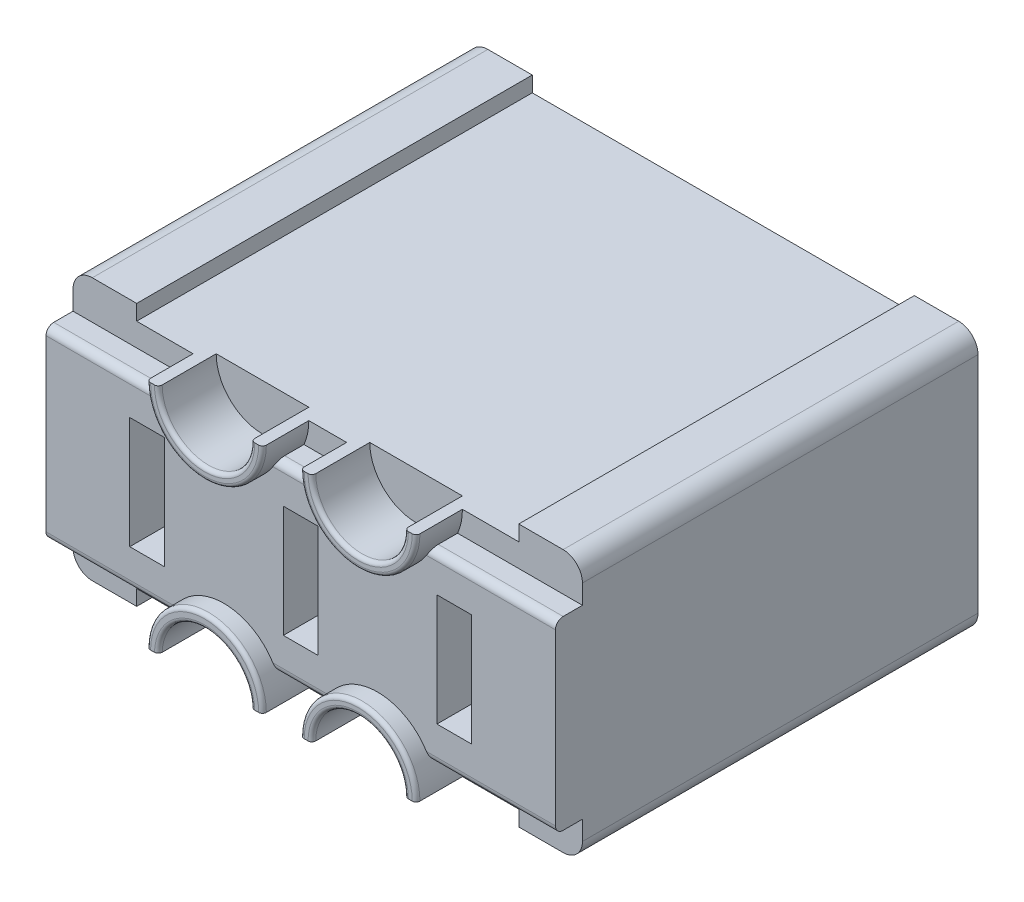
ISO-10303-21;
HEADER;
FILE_DESCRIPTION(('STEP AP214'),'2;1');
FILE_NAME('part.step','',(''),(''),'','','');
FILE_SCHEMA(('AUTOMOTIVE_DESIGN { 1 0 10303 214 1 1 1 1 }'));
ENDSEC;
DATA;
#1=APPLICATION_CONTEXT('core data for automotive mechanical design processes');
#2=APPLICATION_PROTOCOL_DEFINITION('international standard','automotive_design',2000,#1);
#3=PRODUCT_CONTEXT('',#1,'mechanical');
#4=PRODUCT('Part','Part','',(#3));
#5=PRODUCT_RELATED_PRODUCT_CATEGORY('part','',(#4));
#6=PRODUCT_DEFINITION_FORMATION('','',#4);
#7=PRODUCT_DEFINITION_CONTEXT('part definition',#1,'design');
#8=PRODUCT_DEFINITION('design','',#6,#7);
#9=PRODUCT_DEFINITION_SHAPE('','',#8);
#10=(LENGTH_UNIT() NAMED_UNIT(*) SI_UNIT(.MILLI.,.METRE.));
#11=(NAMED_UNIT(*) PLANE_ANGLE_UNIT() SI_UNIT($,.RADIAN.));
#12=(NAMED_UNIT(*) SI_UNIT($,.STERADIAN.) SOLID_ANGLE_UNIT());
#13=UNCERTAINTY_MEASURE_WITH_UNIT(LENGTH_MEASURE(1.E-05),#10,'distance_accuracy_value','');
#14=(GEOMETRIC_REPRESENTATION_CONTEXT(3) GLOBAL_UNCERTAINTY_ASSIGNED_CONTEXT((#13)) GLOBAL_UNIT_ASSIGNED_CONTEXT((#10,
#11,#12)) REPRESENTATION_CONTEXT('',''));
#15=CARTESIAN_POINT('',(0.,0.,0.));
#16=DIRECTION('',(0.,0.,1.));
#17=DIRECTION('',(1.,0.,0.));
#18=AXIS2_PLACEMENT_3D('',#15,#16,#17);
#19=CARTESIAN_POINT('',(2.17,4.85,-11.45));
#20=DIRECTION('',(-1.,0.,0.));
#21=DIRECTION('',(0.,-1.,0.));
#22=AXIS2_PLACEMENT_3D('',#19,#20,#21);
#23=PLANE('',#22);
#24=DIRECTION('',(0.,-1.,0.));
#25=VECTOR('',#24,1.);
#26=CARTESIAN_POINT('',(2.17,4.85,-10.95));
#27=LINE('',#26,#25);
#28=CARTESIAN_POINT('',(2.17,4.85,-10.95));
#29=VERTEX_POINT('',#28);
#30=CARTESIAN_POINT('',(2.17,1.95,-10.95));
#31=VERTEX_POINT('',#30);
#32=EDGE_CURVE('E58',#29,#31,#27,.T.);
#33=ORIENTED_EDGE('',*,*,#32,.F.);
#34=DIRECTION('',(0.,0.,1.));
#35=VECTOR('',#34,1.);
#36=CARTESIAN_POINT('',(2.17,4.85,-11.45));
#37=LINE('',#36,#35);
#38=CARTESIAN_POINT('',(2.17,4.85,-0.5));
#39=VERTEX_POINT('',#38);
#40=EDGE_CURVE('E608',#29,#39,#37,.T.);
#41=ORIENTED_EDGE('',*,*,#40,.T.);
#42=DIRECTION('',(0.,-1.,0.));
#43=VECTOR('',#42,1.);
#44=CARTESIAN_POINT('',(2.17,4.85,-0.5));
#45=LINE('',#44,#43);
#46=CARTESIAN_POINT('',(2.17,1.95,-0.5));
#47=VERTEX_POINT('',#46);
#48=EDGE_CURVE('E590',#39,#47,#45,.T.);
#49=ORIENTED_EDGE('',*,*,#48,.T.);
#50=DIRECTION('',(0.,0.,1.));
#51=VECTOR('',#50,1.);
#52=CARTESIAN_POINT('',(2.17,1.95,-11.45));
#53=LINE('',#52,#51);
#54=EDGE_CURVE('E607',#31,#47,#53,.T.);
#55=ORIENTED_EDGE('',*,*,#54,.F.);
#56=EDGE_LOOP('',(#33,#41,#49,#55));
#57=FACE_BOUND('',#56,.T.);
#58=ADVANCED_FACE('F34',(#57),#23,.F.);
#59=CARTESIAN_POINT('',(2.17,4.85,-11.45));
#60=DIRECTION('',(0.,1.,0.));
#61=DIRECTION('',(0.,0.,1.));
#62=AXIS2_PLACEMENT_3D('',#59,#60,#61);
#63=PLANE('',#62);
#64=DIRECTION('',(-1.,0.,0.));
#65=VECTOR('',#64,1.);
#66=CARTESIAN_POINT('',(2.17,4.85,-10.95));
#67=LINE('',#66,#65);
#68=CARTESIAN_POINT('',(3.07,4.85,-10.95));
#69=VERTEX_POINT('',#68);
#70=EDGE_CURVE('E552',#69,#29,#67,.T.);
#71=ORIENTED_EDGE('',*,*,#70,.F.);
#72=DIRECTION('',(0.,0.,1.));
#73=VECTOR('',#72,1.);
#74=CARTESIAN_POINT('',(3.07,4.85,-11.45));
#75=LINE('',#74,#73);
#76=CARTESIAN_POINT('',(3.07,4.85,-0.5));
#77=VERTEX_POINT('',#76);
#78=EDGE_CURVE('E611',#69,#77,#75,.T.);
#79=ORIENTED_EDGE('',*,*,#78,.T.);
#80=DIRECTION('',(-1.,0.,0.));
#81=VECTOR('',#80,1.);
#82=CARTESIAN_POINT('',(2.17,4.85,-0.5));
#83=LINE('',#82,#81);
#84=EDGE_CURVE('E604',#77,#39,#83,.T.);
#85=ORIENTED_EDGE('',*,*,#84,.T.);
#86=ORIENTED_EDGE('',*,*,#40,.F.);
#87=EDGE_LOOP('',(#71,#79,#85,#86));
#88=FACE_BOUND('',#87,.T.);
#89=ADVANCED_FACE('F1034',(#88),#63,.F.);
#90=CARTESIAN_POINT('',(3.07,4.85,-11.45));
#91=DIRECTION('',(1.,0.,0.));
#92=DIRECTION('',(0.,1.,0.));
#93=AXIS2_PLACEMENT_3D('',#90,#91,#92);
#94=PLANE('',#93);
#95=DIRECTION('',(0.,1.,0.));
#96=VECTOR('',#95,1.);
#97=CARTESIAN_POINT('',(3.07,4.85,-10.95));
#98=LINE('',#97,#96);
#99=CARTESIAN_POINT('',(3.07,1.95,-10.95));
#100=VERTEX_POINT('',#99);
#101=EDGE_CURVE('E550',#100,#69,#98,.T.);
#102=ORIENTED_EDGE('',*,*,#101,.F.);
#103=DIRECTION('',(0.,0.,1.));
#104=VECTOR('',#103,1.);
#105=CARTESIAN_POINT('',(3.07,1.95,-11.45));
#106=LINE('',#105,#104);
#107=CARTESIAN_POINT('',(3.07,1.95,-0.5));
#108=VERTEX_POINT('',#107);
#109=EDGE_CURVE('E613',#100,#108,#106,.T.);
#110=ORIENTED_EDGE('',*,*,#109,.T.);
#111=DIRECTION('',(0.,1.,0.));
#112=VECTOR('',#111,1.);
#113=CARTESIAN_POINT('',(3.07,4.85,-0.5));
#114=LINE('',#113,#112);
#115=EDGE_CURVE('E601',#108,#77,#114,.T.);
#116=ORIENTED_EDGE('',*,*,#115,.T.);
#117=ORIENTED_EDGE('',*,*,#78,.F.);
#118=EDGE_LOOP('',(#102,#110,#116,#117));
#119=FACE_BOUND('',#118,.T.);
#120=ADVANCED_FACE('F1040',(#119),#94,.F.);
#121=CARTESIAN_POINT('',(2.17,1.95,-11.45));
#122=DIRECTION('',(0.,-1.,0.));
#123=DIRECTION('',(0.,0.,-1.));
#124=AXIS2_PLACEMENT_3D('',#121,#122,#123);
#125=PLANE('',#124);
#126=DIRECTION('',(1.,0.,0.));
#127=VECTOR('',#126,1.);
#128=CARTESIAN_POINT('',(2.17,1.95,-10.95));
#129=LINE('',#128,#127);
#130=EDGE_CURVE('E548',#31,#100,#129,.T.);
#131=ORIENTED_EDGE('',*,*,#130,.F.);
#132=ORIENTED_EDGE('',*,*,#54,.T.);
#133=DIRECTION('',(1.,0.,0.));
#134=VECTOR('',#133,1.);
#135=CARTESIAN_POINT('',(2.17,1.95,-0.5));
#136=LINE('',#135,#134);
#137=EDGE_CURVE('E598',#47,#108,#136,.T.);
#138=ORIENTED_EDGE('',*,*,#137,.T.);
#139=ORIENTED_EDGE('',*,*,#109,.F.);
#140=EDGE_LOOP('',(#131,#132,#138,#139));
#141=FACE_BOUND('',#140,.T.);
#142=ADVANCED_FACE('F1045',(#141),#125,.F.);
#143=CARTESIAN_POINT('',(6.15,4.85,-11.45));
#144=DIRECTION('',(-1.,0.,0.));
#145=DIRECTION('',(0.,0.,1.));
#146=AXIS2_PLACEMENT_3D('',#143,#144,#145);
#147=PLANE('',#146);
#148=DIRECTION('',(0.,-1.,0.));
#149=VECTOR('',#148,1.);
#150=CARTESIAN_POINT('',(6.15,4.85,-10.95));
#151=LINE('',#150,#149);
#152=CARTESIAN_POINT('',(6.15,4.85,-10.95));
#153=VERTEX_POINT('',#152);
#154=CARTESIAN_POINT('',(6.15,1.95,-10.95));
#155=VERTEX_POINT('',#154);
#156=EDGE_CURVE('E546',#153,#155,#151,.T.);
#157=ORIENTED_EDGE('',*,*,#156,.F.);
#158=DIRECTION('',(0.,0.,1.));
#159=VECTOR('',#158,1.);
#160=CARTESIAN_POINT('',(6.15,4.85,-11.45));
#161=LINE('',#160,#159);
#162=CARTESIAN_POINT('',(6.15,4.85,-0.5));
#163=VERTEX_POINT('',#162);
#164=EDGE_CURVE('E588',#153,#163,#161,.T.);
#165=ORIENTED_EDGE('',*,*,#164,.T.);
#166=DIRECTION('',(0.,-1.,0.));
#167=VECTOR('',#166,1.);
#168=CARTESIAN_POINT('',(6.15,4.85,-0.5));
#169=LINE('',#168,#167);
#170=CARTESIAN_POINT('',(6.15,1.95,-0.5));
#171=VERTEX_POINT('',#170);
#172=EDGE_CURVE('E570',#163,#171,#169,.T.);
#173=ORIENTED_EDGE('',*,*,#172,.T.);
#174=DIRECTION('',(0.,0.,1.));
#175=VECTOR('',#174,1.);
#176=CARTESIAN_POINT('',(6.15,1.95,-11.45));
#177=LINE('',#176,#175);
#178=EDGE_CURVE('E587',#155,#171,#177,.T.);
#179=ORIENTED_EDGE('',*,*,#178,.F.);
#180=EDGE_LOOP('',(#157,#165,#173,#179));
#181=FACE_BOUND('',#180,.T.);
#182=ADVANCED_FACE('F1516',(#181),#147,.F.);
#183=CARTESIAN_POINT('',(6.15,4.85,-11.45));
#184=DIRECTION('',(0.,1.,0.));
#185=DIRECTION('',(0.,0.,1.));
#186=AXIS2_PLACEMENT_3D('',#183,#184,#185);
#187=PLANE('',#186);
#188=DIRECTION('',(-1.,0.,0.));
#189=VECTOR('',#188,1.);
#190=CARTESIAN_POINT('',(6.15,4.85,-10.95));
#191=LINE('',#190,#189);
#192=CARTESIAN_POINT('',(7.05,4.85,-10.95));
#193=VERTEX_POINT('',#192);
#194=EDGE_CURVE('E544',#193,#153,#191,.T.);
#195=ORIENTED_EDGE('',*,*,#194,.F.);
#196=DIRECTION('',(0.,0.,1.));
#197=VECTOR('',#196,1.);
#198=CARTESIAN_POINT('',(7.05,4.85,-11.45));
#199=LINE('',#198,#197);
#200=CARTESIAN_POINT('',(7.05,4.85,-0.5));
#201=VERTEX_POINT('',#200);
#202=EDGE_CURVE('E591',#193,#201,#199,.T.);
#203=ORIENTED_EDGE('',*,*,#202,.T.);
#204=DIRECTION('',(-1.,0.,0.));
#205=VECTOR('',#204,1.);
#206=CARTESIAN_POINT('',(6.15,4.85,-0.5));
#207=LINE('',#206,#205);
#208=EDGE_CURVE('E584',#201,#163,#207,.T.);
#209=ORIENTED_EDGE('',*,*,#208,.T.);
#210=ORIENTED_EDGE('',*,*,#164,.F.);
#211=EDGE_LOOP('',(#195,#203,#209,#210));
#212=FACE_BOUND('',#211,.T.);
#213=ADVANCED_FACE('F1512',(#212),#187,.F.);
#214=CARTESIAN_POINT('',(7.05,4.85,-11.45));
#215=DIRECTION('',(1.,0.,0.));
#216=DIRECTION('',(0.,0.,-1.));
#217=AXIS2_PLACEMENT_3D('',#214,#215,#216);
#218=PLANE('',#217);
#219=DIRECTION('',(0.,1.,0.));
#220=VECTOR('',#219,1.);
#221=CARTESIAN_POINT('',(7.05,4.85,-10.95));
#222=LINE('',#221,#220);
#223=CARTESIAN_POINT('',(7.05,1.95,-10.95));
#224=VERTEX_POINT('',#223);
#225=EDGE_CURVE('E542',#224,#193,#222,.T.);
#226=ORIENTED_EDGE('',*,*,#225,.F.);
#227=DIRECTION('',(0.,0.,1.));
#228=VECTOR('',#227,1.);
#229=CARTESIAN_POINT('',(7.05,1.95,-11.45));
#230=LINE('',#229,#228);
#231=CARTESIAN_POINT('',(7.05,1.95,-0.5));
#232=VERTEX_POINT('',#231);
#233=EDGE_CURVE('E593',#224,#232,#230,.T.);
#234=ORIENTED_EDGE('',*,*,#233,.T.);
#235=DIRECTION('',(0.,1.,0.));
#236=VECTOR('',#235,1.);
#237=CARTESIAN_POINT('',(7.05,4.85,-0.5));
#238=LINE('',#237,#236);
#239=EDGE_CURVE('E581',#232,#201,#238,.T.);
#240=ORIENTED_EDGE('',*,*,#239,.T.);
#241=ORIENTED_EDGE('',*,*,#202,.F.);
#242=EDGE_LOOP('',(#226,#234,#240,#241));
#243=FACE_BOUND('',#242,.T.);
#244=ADVANCED_FACE('F1515',(#243),#218,.F.);
#245=CARTESIAN_POINT('',(6.15,1.95,-11.45));
#246=DIRECTION('',(0.,-1.,0.));
#247=DIRECTION('',(0.,0.,-1.));
#248=AXIS2_PLACEMENT_3D('',#245,#246,#247);
#249=PLANE('',#248);
#250=DIRECTION('',(1.,0.,0.));
#251=VECTOR('',#250,1.);
#252=CARTESIAN_POINT('',(6.15,1.95,-10.95));
#253=LINE('',#252,#251);
#254=EDGE_CURVE('E540',#155,#224,#253,.T.);
#255=ORIENTED_EDGE('',*,*,#254,.F.);
#256=ORIENTED_EDGE('',*,*,#178,.T.);
#257=DIRECTION('',(1.,0.,0.));
#258=VECTOR('',#257,1.);
#259=CARTESIAN_POINT('',(6.15,1.95,-0.5));
#260=LINE('',#259,#258);
#261=EDGE_CURVE('E578',#171,#232,#260,.T.);
#262=ORIENTED_EDGE('',*,*,#261,.T.);
#263=ORIENTED_EDGE('',*,*,#233,.F.);
#264=EDGE_LOOP('',(#255,#256,#262,#263));
#265=FACE_BOUND('',#264,.T.);
#266=ADVANCED_FACE('F1510',(#265),#249,.F.);
#267=CARTESIAN_POINT('',(10.13,4.85,-11.45));
#268=DIRECTION('',(-1.,0.,0.));
#269=DIRECTION('',(0.,0.,1.));
#270=AXIS2_PLACEMENT_3D('',#267,#268,#269);
#271=PLANE('',#270);
#272=DIRECTION('',(0.,-1.,0.));
#273=VECTOR('',#272,1.);
#274=CARTESIAN_POINT('',(10.13,4.85,-10.95));
#275=LINE('',#274,#273);
#276=CARTESIAN_POINT('',(10.13,4.85,-10.95));
#277=VERTEX_POINT('',#276);
#278=CARTESIAN_POINT('',(10.13,1.95,-10.95));
#279=VERTEX_POINT('',#278);
#280=EDGE_CURVE('E538',#277,#279,#275,.T.);
#281=ORIENTED_EDGE('',*,*,#280,.F.);
#282=DIRECTION('',(0.,0.,1.));
#283=VECTOR('',#282,1.);
#284=CARTESIAN_POINT('',(10.13,4.85,-11.45));
#285=LINE('',#284,#283);
#286=CARTESIAN_POINT('',(10.13,4.85,-0.5));
#287=VERTEX_POINT('',#286);
#288=EDGE_CURVE('E568',#277,#287,#285,.T.);
#289=ORIENTED_EDGE('',*,*,#288,.T.);
#290=DIRECTION('',(0.,-1.,0.));
#291=VECTOR('',#290,1.);
#292=CARTESIAN_POINT('',(10.13,4.85,-0.5));
#293=LINE('',#292,#291);
#294=CARTESIAN_POINT('',(10.13,1.95,-0.5));
#295=VERTEX_POINT('',#294);
#296=EDGE_CURVE('E555',#287,#295,#293,.T.);
#297=ORIENTED_EDGE('',*,*,#296,.T.);
#298=DIRECTION('',(0.,0.,1.));
#299=VECTOR('',#298,1.);
#300=CARTESIAN_POINT('',(10.13,1.95,-11.45));
#301=LINE('',#300,#299);
#302=EDGE_CURVE('E567',#279,#295,#301,.T.);
#303=ORIENTED_EDGE('',*,*,#302,.F.);
#304=EDGE_LOOP('',(#281,#289,#297,#303));
#305=FACE_BOUND('',#304,.T.);
#306=ADVANCED_FACE('F1500',(#305),#271,.F.);
#307=CARTESIAN_POINT('',(10.13,4.85,-11.45));
#308=DIRECTION('',(0.,1.,0.));
#309=DIRECTION('',(0.,0.,1.));
#310=AXIS2_PLACEMENT_3D('',#307,#308,#309);
#311=PLANE('',#310);
#312=DIRECTION('',(-1.,0.,0.));
#313=VECTOR('',#312,1.);
#314=CARTESIAN_POINT('',(10.13,4.85,-10.95));
#315=LINE('',#314,#313);
#316=CARTESIAN_POINT('',(11.03,4.85,-10.95));
#317=VERTEX_POINT('',#316);
#318=EDGE_CURVE('E536',#317,#277,#315,.T.);
#319=ORIENTED_EDGE('',*,*,#318,.F.);
#320=DIRECTION('',(0.,0.,1.));
#321=VECTOR('',#320,1.);
#322=CARTESIAN_POINT('',(11.03,4.85,-11.45));
#323=LINE('',#322,#321);
#324=CARTESIAN_POINT('',(11.03,4.85,-0.5));
#325=VERTEX_POINT('',#324);
#326=EDGE_CURVE('E571',#317,#325,#323,.T.);
#327=ORIENTED_EDGE('',*,*,#326,.T.);
#328=DIRECTION('',(-1.,0.,0.));
#329=VECTOR('',#328,1.);
#330=CARTESIAN_POINT('',(10.13,4.85,-0.5));
#331=LINE('',#330,#329);
#332=EDGE_CURVE('E564',#325,#287,#331,.T.);
#333=ORIENTED_EDGE('',*,*,#332,.T.);
#334=ORIENTED_EDGE('',*,*,#288,.F.);
#335=EDGE_LOOP('',(#319,#327,#333,#334));
#336=FACE_BOUND('',#335,.T.);
#337=ADVANCED_FACE('F1496',(#336),#311,.F.);
#338=CARTESIAN_POINT('',(11.03,4.85,-11.45));
#339=DIRECTION('',(1.,0.,0.));
#340=DIRECTION('',(0.,0.,-1.));
#341=AXIS2_PLACEMENT_3D('',#338,#339,#340);
#342=PLANE('',#341);
#343=DIRECTION('',(0.,1.,0.));
#344=VECTOR('',#343,1.);
#345=CARTESIAN_POINT('',(11.03,4.85,-10.95));
#346=LINE('',#345,#344);
#347=CARTESIAN_POINT('',(11.03,1.95,-10.95));
#348=VERTEX_POINT('',#347);
#349=EDGE_CURVE('E531',#348,#317,#346,.T.);
#350=ORIENTED_EDGE('',*,*,#349,.F.);
#351=DIRECTION('',(0.,0.,1.));
#352=VECTOR('',#351,1.);
#353=CARTESIAN_POINT('',(11.03,1.95,-11.45));
#354=LINE('',#353,#352);
#355=CARTESIAN_POINT('',(11.03,1.95,-0.5));
#356=VERTEX_POINT('',#355);
#357=EDGE_CURVE('E573',#348,#356,#354,.T.);
#358=ORIENTED_EDGE('',*,*,#357,.T.);
#359=DIRECTION('',(0.,1.,0.));
#360=VECTOR('',#359,1.);
#361=CARTESIAN_POINT('',(11.03,4.85,-0.5));
#362=LINE('',#361,#360);
#363=EDGE_CURVE('E561',#356,#325,#362,.T.);
#364=ORIENTED_EDGE('',*,*,#363,.T.);
#365=ORIENTED_EDGE('',*,*,#326,.F.);
#366=EDGE_LOOP('',(#350,#358,#364,#365));
#367=FACE_BOUND('',#366,.T.);
#368=ADVANCED_FACE('F1499',(#367),#342,.F.);
#369=CARTESIAN_POINT('',(10.13,1.95,-11.45));
#370=DIRECTION('',(0.,-1.,0.));
#371=DIRECTION('',(0.,0.,-1.));
#372=AXIS2_PLACEMENT_3D('',#369,#370,#371);
#373=PLANE('',#372);
#374=DIRECTION('',(1.,0.,0.));
#375=VECTOR('',#374,1.);
#376=CARTESIAN_POINT('',(10.13,1.95,-10.95));
#377=LINE('',#376,#375);
#378=EDGE_CURVE('E11',#279,#348,#377,.T.);
#379=ORIENTED_EDGE('',*,*,#378,.F.);
#380=ORIENTED_EDGE('',*,*,#302,.T.);
#381=DIRECTION('',(1.,0.,0.));
#382=VECTOR('',#381,1.);
#383=CARTESIAN_POINT('',(10.13,1.95,-0.5));
#384=LINE('',#383,#382);
#385=EDGE_CURVE('E558',#295,#356,#384,.T.);
#386=ORIENTED_EDGE('',*,*,#385,.T.);
#387=ORIENTED_EDGE('',*,*,#357,.F.);
#388=EDGE_LOOP('',(#379,#380,#386,#387));
#389=FACE_BOUND('',#388,.T.);
#390=ADVANCED_FACE('F1007',(#389),#373,.F.);
#391=CARTESIAN_POINT('',(0.,0.,-11.45));
#392=DIRECTION('',(0.,-1.,0.));
#393=DIRECTION('',(0.,0.,-1.));
#394=AXIS2_PLACEMENT_3D('',#391,#392,#393);
#395=PLANE('',#394);
#396=DIRECTION('',(1.,0.,0.));
#397=VECTOR('',#396,1.);
#398=CARTESIAN_POINT('',(0.,0.,-1.2));
#399=LINE('',#398,#397);
#400=CARTESIAN_POINT('',(0.5,0.,-1.2));
#401=VERTEX_POINT('',#400);
#402=CARTESIAN_POINT('',(1.65,0.,-1.2));
#403=VERTEX_POINT('',#402);
#404=EDGE_CURVE('E624',#401,#403,#399,.T.);
#405=ORIENTED_EDGE('',*,*,#404,.F.);
#406=DIRECTION('',(0.,0.,1.));
#407=VECTOR('',#406,1.);
#408=CARTESIAN_POINT('',(0.5,0.,-11.45));
#409=LINE('',#408,#407);
#410=CARTESIAN_POINT('',(0.5,0.,-11.45));
#411=VERTEX_POINT('',#410);
#412=EDGE_CURVE('E914',#401,#411,#409,.F.);
#413=ORIENTED_EDGE('',*,*,#412,.T.);
#414=DIRECTION('',(1.,0.,0.));
#415=VECTOR('',#414,1.);
#416=CARTESIAN_POINT('',(0.,0.,-11.45));
#417=LINE('',#416,#415);
#418=CARTESIAN_POINT('',(1.65,0.,-11.45));
#419=VERTEX_POINT('',#418);
#420=EDGE_CURVE('E877',#411,#419,#417,.T.);
#421=ORIENTED_EDGE('',*,*,#420,.T.);
#422=DIRECTION('',(0.,0.,1.));
#423=VECTOR('',#422,1.);
#424=CARTESIAN_POINT('',(1.65,0.,-11.45));
#425=LINE('',#424,#423);
#426=EDGE_CURVE('E832',#419,#403,#425,.T.);
#427=ORIENTED_EDGE('',*,*,#426,.T.);
#428=EDGE_LOOP('',(#405,#413,#421,#427));
#429=FACE_BOUND('',#428,.T.);
#430=ADVANCED_FACE('F973',(#429),#395,.T.);
#431=CARTESIAN_POINT('',(1.65,0.,-11.45));
#432=DIRECTION('',(-1.,0.,0.));
#433=DIRECTION('',(0.,0.,1.));
#434=AXIS2_PLACEMENT_3D('',#431,#432,#433);
#435=PLANE('',#434);
#436=DIRECTION('',(0.,1.,0.));
#437=VECTOR('',#436,1.);
#438=CARTESIAN_POINT('',(1.65,0.,-1.2));
#439=LINE('',#438,#437);
#440=CARTESIAN_POINT('',(1.65,0.4,-1.2));
#441=VERTEX_POINT('',#440);
#442=EDGE_CURVE('E626',#403,#441,#439,.T.);
#443=ORIENTED_EDGE('',*,*,#442,.F.);
#444=ORIENTED_EDGE('',*,*,#426,.F.);
#445=DIRECTION('',(0.,-1.,0.));
#446=VECTOR('',#445,1.);
#447=CARTESIAN_POINT('',(1.65,0.,-11.45));
#448=LINE('',#447,#446);
#449=CARTESIAN_POINT('',(1.65,0.4,-11.45));
#450=VERTEX_POINT('',#449);
#451=EDGE_CURVE('E822',#450,#419,#448,.T.);
#452=ORIENTED_EDGE('',*,*,#451,.F.);
#453=DIRECTION('',(0.,0.,1.));
#454=VECTOR('',#453,1.);
#455=CARTESIAN_POINT('',(1.65,0.4,-11.45));
#456=LINE('',#455,#454);
#457=EDGE_CURVE('E836',#450,#441,#456,.T.);
#458=ORIENTED_EDGE('',*,*,#457,.T.);
#459=EDGE_LOOP('',(#443,#444,#452,#458));
#460=FACE_BOUND('',#459,.T.);
#461=ADVANCED_FACE('F969',(#460),#435,.F.);
#462=CARTESIAN_POINT('',(4.61,6.4,-0.5));
#463=DIRECTION('',(0.,0.,1.));
#464=DIRECTION('',(1.,0.,0.));
#465=AXIS2_PLACEMENT_3D('',#462,#463,#464);
#466=PLANE('',#465);
#467=ORIENTED_EDGE('',*,*,#296,.F.);
#468=ORIENTED_EDGE('',*,*,#332,.F.);
#469=ORIENTED_EDGE('',*,*,#363,.F.);
#470=ORIENTED_EDGE('',*,*,#385,.F.);
#471=EDGE_LOOP('',(#467,#468,#469,#470));
#472=FACE_BOUND('',#471,.T.);
#473=ORIENTED_EDGE('',*,*,#172,.F.);
#474=ORIENTED_EDGE('',*,*,#208,.F.);
#475=ORIENTED_EDGE('',*,*,#239,.F.);
#476=ORIENTED_EDGE('',*,*,#261,.F.);
#477=EDGE_LOOP('',(#473,#474,#475,#476));
#478=FACE_BOUND('',#477,.T.);
#479=ORIENTED_EDGE('',*,*,#48,.F.);
#480=ORIENTED_EDGE('',*,*,#84,.F.);
#481=ORIENTED_EDGE('',*,*,#115,.F.);
#482=ORIENTED_EDGE('',*,*,#137,.F.);
#483=EDGE_LOOP('',(#479,#480,#481,#482));
#484=FACE_BOUND('',#483,.T.);
#485=DIRECTION('',(0.,-1.,0.));
#486=VECTOR('',#485,1.);
#487=CARTESIAN_POINT('',(0.,6.8,-0.5));
#488=LINE('',#487,#486);
#489=CARTESIAN_POINT('',(0.,5.6,-0.5));
#490=VERTEX_POINT('',#489);
#491=CARTESIAN_POINT('',(0.,1.2,-0.5));
#492=VERTEX_POINT('',#491);
#493=EDGE_CURVE('E782',#490,#492,#488,.T.);
#494=ORIENTED_EDGE('',*,*,#493,.T.);
#495=DIRECTION('',(-1.,0.,0.));
#496=VECTOR('',#495,1.);
#497=CARTESIAN_POINT('',(3.23522729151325,1.2,-0.5));
#498=LINE('',#497,#496);
#499=CARTESIAN_POINT('',(3.34114224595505,1.2,-0.5));
#500=VERTEX_POINT('',#499);
#501=EDGE_CURVE('E1314',#492,#500,#498,.F.);
#502=ORIENTED_EDGE('',*,*,#501,.T.);
#503=CARTESIAN_POINT('',(4.61,0.4,-0.5));
#504=DIRECTION('',(0.,0.,-1.));
#505=DIRECTION('',(1.,0.,0.));
#506=AXIS2_PLACEMENT_3D('',#503,#504,#505);
#507=CIRCLE('',#506,1.5);
#508=CARTESIAN_POINT('',(5.87885775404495,1.2,-0.5));
#509=VERTEX_POINT('',#508);
#510=EDGE_CURVE('E785',#500,#509,#507,.T.);
#511=ORIENTED_EDGE('',*,*,#510,.T.);
#512=DIRECTION('',(1.,0.,0.));
#513=VECTOR('',#512,1.);
#514=CARTESIAN_POINT('',(4.61,1.2,-0.5));
#515=LINE('',#514,#513);
#516=CARTESIAN_POINT('',(7.32114224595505,1.2,-0.5));
#517=VERTEX_POINT('',#516);
#518=EDGE_CURVE('E1311',#509,#517,#515,.T.);
#519=ORIENTED_EDGE('',*,*,#518,.T.);
#520=CARTESIAN_POINT('',(8.59,0.4,-0.5));
#521=DIRECTION('',(0.,0.,-1.));
#522=DIRECTION('',(1.,0.,0.));
#523=AXIS2_PLACEMENT_3D('',#520,#521,#522);
#524=CIRCLE('',#523,1.5);
#525=CARTESIAN_POINT('',(9.85885775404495,1.2,-0.5));
#526=VERTEX_POINT('',#525);
#527=EDGE_CURVE('E788',#517,#526,#524,.T.);
#528=ORIENTED_EDGE('',*,*,#527,.T.);
#529=DIRECTION('',(1.,0.,0.));
#530=VECTOR('',#529,1.);
#531=CARTESIAN_POINT('',(4.61,1.2,-0.5));
#532=LINE('',#531,#530);
#533=CARTESIAN_POINT('',(13.2,1.2,-0.5));
#534=VERTEX_POINT('',#533);
#535=EDGE_CURVE('E1309',#526,#534,#532,.T.);
#536=ORIENTED_EDGE('',*,*,#535,.T.);
#537=DIRECTION('',(0.,1.,0.));
#538=VECTOR('',#537,1.);
#539=CARTESIAN_POINT('',(13.2,0.,-0.5));
#540=LINE('',#539,#538);
#541=CARTESIAN_POINT('',(13.2,5.6,-0.5));
#542=VERTEX_POINT('',#541);
#543=EDGE_CURVE('E791',#534,#542,#540,.T.);
#544=ORIENTED_EDGE('',*,*,#543,.T.);
#545=DIRECTION('',(-1.,0.,0.));
#546=VECTOR('',#545,1.);
#547=CARTESIAN_POINT('',(4.61,5.6,-0.5));
#548=LINE('',#547,#546);
#549=CARTESIAN_POINT('',(9.85885775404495,5.6,-0.5));
#550=VERTEX_POINT('',#549);
#551=EDGE_CURVE('E1306',#542,#550,#548,.T.);
#552=ORIENTED_EDGE('',*,*,#551,.T.);
#553=CARTESIAN_POINT('',(8.59,6.4,-0.5));
#554=DIRECTION('',(0.,0.,-1.));
#555=DIRECTION('',(1.,0.,0.));
#556=AXIS2_PLACEMENT_3D('',#553,#554,#555);
#557=CIRCLE('',#556,1.5);
#558=CARTESIAN_POINT('',(7.32114224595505,5.6,-0.5));
#559=VERTEX_POINT('',#558);
#560=EDGE_CURVE('E794',#550,#559,#557,.T.);
#561=ORIENTED_EDGE('',*,*,#560,.T.);
#562=DIRECTION('',(1.,0.,0.));
#563=VECTOR('',#562,1.);
#564=CARTESIAN_POINT('',(5.98477270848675,5.6,-0.5));
#565=LINE('',#564,#563);
#566=CARTESIAN_POINT('',(5.87885775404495,5.6,-0.5));
#567=VERTEX_POINT('',#566);
#568=EDGE_CURVE('E1304',#559,#567,#565,.F.);
#569=ORIENTED_EDGE('',*,*,#568,.T.);
#570=CARTESIAN_POINT('',(4.61,6.4,-0.5));
#571=DIRECTION('',(0.,0.,-1.));
#572=DIRECTION('',(1.,0.,0.));
#573=AXIS2_PLACEMENT_3D('',#570,#571,#572);
#574=CIRCLE('',#573,1.5);
#575=CARTESIAN_POINT('',(3.34114224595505,5.6,-0.5));
#576=VERTEX_POINT('',#575);
#577=EDGE_CURVE('E777',#567,#576,#574,.T.);
#578=ORIENTED_EDGE('',*,*,#577,.T.);
#579=DIRECTION('',(1.,0.,0.));
#580=VECTOR('',#579,1.);
#581=CARTESIAN_POINT('',(0.,5.6,-0.5));
#582=LINE('',#581,#580);
#583=EDGE_CURVE('E1296',#576,#490,#582,.F.);
#584=ORIENTED_EDGE('',*,*,#583,.T.);
#585=EDGE_LOOP('',(#494,#502,#511,#519,#528,#536,#544,#552,#561,#569,#578,#584));
#586=FACE_BOUND('',#585,.T.);
#587=ADVANCED_FACE('F972',(#472,#478,#484,#586),#466,.T.);
#588=CARTESIAN_POINT('',(13.2,0.,-11.45));
#589=DIRECTION('',(1.,0.,0.));
#590=DIRECTION('',(0.,0.,-1.));
#591=AXIS2_PLACEMENT_3D('',#588,#589,#590);
#592=PLANE('',#591);
#593=ORIENTED_EDGE('',*,*,#543,.F.);
#594=CARTESIAN_POINT('',(13.2,1.2,-0.7));
#595=DIRECTION('',(1.,0.,0.));
#596=DIRECTION('',(0.,0.,-1.));
#597=AXIS2_PLACEMENT_3D('',#594,#595,#596);
#598=CIRCLE('',#597,0.2);
#599=CARTESIAN_POINT('',(13.2,1.,-0.7));
#600=VERTEX_POINT('',#599);
#601=EDGE_CURVE('E1262',#534,#600,#598,.T.);
#602=ORIENTED_EDGE('',*,*,#601,.T.);
#603=DIRECTION('',(0.,0.,1.));
#604=VECTOR('',#603,1.);
#605=CARTESIAN_POINT('',(13.2,1.,-1.2));
#606=LINE('',#605,#604);
#607=CARTESIAN_POINT('',(13.2,1.,-1.2));
#608=VERTEX_POINT('',#607);
#609=EDGE_CURVE('E670',#608,#600,#606,.T.);
#610=ORIENTED_EDGE('',*,*,#609,.F.);
#611=DIRECTION('',(0.,1.,0.));
#612=VECTOR('',#611,1.);
#613=CARTESIAN_POINT('',(13.2,0.,-1.2));
#614=LINE('',#613,#612);
#615=CARTESIAN_POINT('',(13.2,0.5,-1.2));
#616=VERTEX_POINT('',#615);
#617=EDGE_CURVE('E667',#616,#608,#614,.T.);
#618=ORIENTED_EDGE('',*,*,#617,.F.);
#619=DIRECTION('',(0.,0.,1.));
#620=VECTOR('',#619,1.);
#621=CARTESIAN_POINT('',(13.2,0.5,-11.45));
#622=LINE('',#621,#620);
#623=CARTESIAN_POINT('',(13.2,0.5,-11.45));
#624=VERTEX_POINT('',#623);
#625=EDGE_CURVE('E893',#616,#624,#622,.F.);
#626=ORIENTED_EDGE('',*,*,#625,.T.);
#627=DIRECTION('',(0.,1.,0.));
#628=VECTOR('',#627,1.);
#629=CARTESIAN_POINT('',(13.2,0.,-11.45));
#630=LINE('',#629,#628);
#631=CARTESIAN_POINT('',(13.2,6.3,-11.45));
#632=VERTEX_POINT('',#631);
#633=EDGE_CURVE('E879',#624,#632,#630,.T.);
#634=ORIENTED_EDGE('',*,*,#633,.T.);
#635=DIRECTION('',(0.,0.,1.));
#636=VECTOR('',#635,1.);
#637=CARTESIAN_POINT('',(13.2,6.3,-11.45));
#638=LINE('',#637,#636);
#639=CARTESIAN_POINT('',(13.2,6.3,-1.2));
#640=VERTEX_POINT('',#639);
#641=EDGE_CURVE('E890',#632,#640,#638,.T.);
#642=ORIENTED_EDGE('',*,*,#641,.T.);
#643=DIRECTION('',(0.,1.,0.));
#644=VECTOR('',#643,1.);
#645=CARTESIAN_POINT('',(13.2,0.,-1.2));
#646=LINE('',#645,#644);
#647=CARTESIAN_POINT('',(13.2,5.8,-1.2));
#648=VERTEX_POINT('',#647);
#649=EDGE_CURVE('E677',#648,#640,#646,.T.);
#650=ORIENTED_EDGE('',*,*,#649,.F.);
#651=DIRECTION('',(0.,0.,1.));
#652=VECTOR('',#651,1.);
#653=CARTESIAN_POINT('',(13.2,5.8,-1.2));
#654=LINE('',#653,#652);
#655=CARTESIAN_POINT('',(13.2,5.8,-0.7));
#656=VERTEX_POINT('',#655);
#657=EDGE_CURVE('E690',#648,#656,#654,.T.);
#658=ORIENTED_EDGE('',*,*,#657,.T.);
#659=CARTESIAN_POINT('',(13.2,5.6,-0.7));
#660=DIRECTION('',(1.,0.,0.));
#661=DIRECTION('',(0.,0.,-1.));
#662=AXIS2_PLACEMENT_3D('',#659,#660,#661);
#663=CIRCLE('',#662,0.2);
#664=EDGE_CURVE('E1272',#656,#542,#663,.T.);
#665=ORIENTED_EDGE('',*,*,#664,.T.);
#666=EDGE_LOOP('',(#593,#602,#610,#618,#626,#634,#642,#650,#658,#665));
#667=FACE_BOUND('',#666,.T.);
#668=ADVANCED_FACE('F1001',(#667),#592,.T.);
#669=CARTESIAN_POINT('',(11.55,0.,-11.45));
#670=VERTEX_POINT('',#669);
#671=CARTESIAN_POINT('',(12.7,0.,-11.45));
#672=VERTEX_POINT('',#671);
#673=EDGE_CURVE('E876',#670,#672,#417,.T.);
#674=ORIENTED_EDGE('',*,*,#673,.T.);
#675=DIRECTION('',(0.,0.,1.));
#676=VECTOR('',#675,1.);
#677=CARTESIAN_POINT('',(12.7,0.,-11.45));
#678=LINE('',#677,#676);
#679=CARTESIAN_POINT('',(12.7,0.,-1.2));
#680=VERTEX_POINT('',#679);
#681=EDGE_CURVE('E885',#672,#680,#678,.T.);
#682=ORIENTED_EDGE('',*,*,#681,.T.);
#683=DIRECTION('',(1.,0.,0.));
#684=VECTOR('',#683,1.);
#685=CARTESIAN_POINT('',(0.,0.,-1.2));
#686=LINE('',#685,#684);
#687=CARTESIAN_POINT('',(11.55,0.,-1.2));
#688=VERTEX_POINT('',#687);
#689=EDGE_CURVE('E664',#688,#680,#686,.T.);
#690=ORIENTED_EDGE('',*,*,#689,.F.);
#691=DIRECTION('',(0.,0.,1.));
#692=VECTOR('',#691,1.);
#693=CARTESIAN_POINT('',(11.55,0.,-11.45));
#694=LINE('',#693,#692);
#695=EDGE_CURVE('E843',#670,#688,#694,.T.);
#696=ORIENTED_EDGE('',*,*,#695,.F.);
#697=EDGE_LOOP('',(#674,#682,#690,#696));
#698=FACE_BOUND('',#697,.T.);
#699=ADVANCED_FACE('F967',(#698),#395,.T.);
#700=CARTESIAN_POINT('',(11.55,0.,-11.45));
#701=DIRECTION('',(1.,0.,0.));
#702=DIRECTION('',(0.,0.,-1.));
#703=AXIS2_PLACEMENT_3D('',#700,#701,#702);
#704=PLANE('',#703);
#705=DIRECTION('',(0.,-1.,0.));
#706=VECTOR('',#705,1.);
#707=CARTESIAN_POINT('',(11.55,0.,-1.2));
#708=LINE('',#707,#706);
#709=CARTESIAN_POINT('',(11.55,0.4,-1.2));
#710=VERTEX_POINT('',#709);
#711=EDGE_CURVE('E662',#710,#688,#708,.T.);
#712=ORIENTED_EDGE('',*,*,#711,.F.);
#713=DIRECTION('',(0.,0.,1.));
#714=VECTOR('',#713,1.);
#715=CARTESIAN_POINT('',(11.55,0.4,-11.45));
#716=LINE('',#715,#714);
#717=CARTESIAN_POINT('',(11.55,0.4,-11.45));
#718=VERTEX_POINT('',#717);
#719=EDGE_CURVE('E840',#718,#710,#716,.T.);
#720=ORIENTED_EDGE('',*,*,#719,.F.);
#721=DIRECTION('',(0.,1.,0.));
#722=VECTOR('',#721,1.);
#723=CARTESIAN_POINT('',(11.55,0.,-11.45));
#724=LINE('',#723,#722);
#725=EDGE_CURVE('E825',#670,#718,#724,.T.);
#726=ORIENTED_EDGE('',*,*,#725,.F.);
#727=ORIENTED_EDGE('',*,*,#695,.T.);
#728=EDGE_LOOP('',(#712,#720,#726,#727));
#729=FACE_BOUND('',#728,.T.);
#730=ADVANCED_FACE('F962',(#729),#704,.F.);
#731=CARTESIAN_POINT('',(0.,6.8,-11.45));
#732=DIRECTION('',(0.,1.,0.));
#733=DIRECTION('',(0.,0.,1.));
#734=AXIS2_PLACEMENT_3D('',#731,#732,#733);
#735=PLANE('',#734);
#736=DIRECTION('',(-1.,0.,0.));
#737=VECTOR('',#736,1.);
#738=CARTESIAN_POINT('',(0.,6.79999999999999,-1.2));
#739=LINE('',#738,#737);
#740=CARTESIAN_POINT('',(12.7,6.8,-1.2));
#741=VERTEX_POINT('',#740);
#742=CARTESIAN_POINT('',(11.55,6.8,-1.2));
#743=VERTEX_POINT('',#742);
#744=EDGE_CURVE('E680',#741,#743,#739,.T.);
#745=ORIENTED_EDGE('',*,*,#744,.F.);
#746=DIRECTION('',(0.,0.,1.));
#747=VECTOR('',#746,1.);
#748=CARTESIAN_POINT('',(12.7,6.8,-11.45));
#749=LINE('',#748,#747);
#750=CARTESIAN_POINT('',(12.7,6.8,-11.45));
#751=VERTEX_POINT('',#750);
#752=EDGE_CURVE('E905',#741,#751,#749,.F.);
#753=ORIENTED_EDGE('',*,*,#752,.T.);
#754=DIRECTION('',(-1.,0.,0.));
#755=VECTOR('',#754,1.);
#756=CARTESIAN_POINT('',(0.,6.8,-11.45));
#757=LINE('',#756,#755);
#758=CARTESIAN_POINT('',(11.55,6.8,-11.45));
#759=VERTEX_POINT('',#758);
#760=EDGE_CURVE('E883',#751,#759,#757,.T.);
#761=ORIENTED_EDGE('',*,*,#760,.T.);
#762=DIRECTION('',(0.,0.,1.));
#763=VECTOR('',#762,1.);
#764=CARTESIAN_POINT('',(11.55,6.8,-11.45));
#765=LINE('',#764,#763);
#766=EDGE_CURVE('E866',#759,#743,#765,.T.);
#767=ORIENTED_EDGE('',*,*,#766,.T.);
#768=EDGE_LOOP('',(#745,#753,#761,#767));
#769=FACE_BOUND('',#768,.T.);
#770=ADVANCED_FACE('F966',(#769),#735,.T.);
#771=CARTESIAN_POINT('',(11.55,6.8,-11.45));
#772=DIRECTION('',(1.,0.,0.));
#773=DIRECTION('',(0.,0.,-1.));
#774=AXIS2_PLACEMENT_3D('',#771,#772,#773);
#775=PLANE('',#774);
#776=DIRECTION('',(0.,-1.,0.));
#777=VECTOR('',#776,1.);
#778=CARTESIAN_POINT('',(11.55,0.,-1.2));
#779=LINE('',#778,#777);
#780=CARTESIAN_POINT('',(11.55,6.4,-1.2));
#781=VERTEX_POINT('',#780);
#782=EDGE_CURVE('E682',#743,#781,#779,.T.);
#783=ORIENTED_EDGE('',*,*,#782,.F.);
#784=ORIENTED_EDGE('',*,*,#766,.F.);
#785=DIRECTION('',(0.,1.,0.));
#786=VECTOR('',#785,1.);
#787=CARTESIAN_POINT('',(11.55,6.8,-11.45));
#788=LINE('',#787,#786);
#789=CARTESIAN_POINT('',(11.55,6.4,-11.45));
#790=VERTEX_POINT('',#789);
#791=EDGE_CURVE('E855',#790,#759,#788,.T.);
#792=ORIENTED_EDGE('',*,*,#791,.F.);
#793=DIRECTION('',(0.,0.,1.));
#794=VECTOR('',#793,1.);
#795=CARTESIAN_POINT('',(11.55,6.4,-11.45));
#796=LINE('',#795,#794);
#797=EDGE_CURVE('E869',#790,#781,#796,.T.);
#798=ORIENTED_EDGE('',*,*,#797,.T.);
#799=EDGE_LOOP('',(#783,#784,#792,#798));
#800=FACE_BOUND('',#799,.T.);
#801=ADVANCED_FACE('F975',(#800),#775,.F.);
#802=CARTESIAN_POINT('',(1.65,6.8,-11.45));
#803=VERTEX_POINT('',#802);
#804=CARTESIAN_POINT('',(0.5,6.8,-11.45));
#805=VERTEX_POINT('',#804);
#806=EDGE_CURVE('E882',#803,#805,#757,.T.);
#807=ORIENTED_EDGE('',*,*,#806,.T.);
#808=DIRECTION('',(0.,0.,1.));
#809=VECTOR('',#808,1.);
#810=CARTESIAN_POINT('',(0.5,6.8,-11.45));
#811=LINE('',#810,#809);
#812=CARTESIAN_POINT('',(0.5,6.8,-1.2));
#813=VERTEX_POINT('',#812);
#814=EDGE_CURVE('E916',#805,#813,#811,.T.);
#815=ORIENTED_EDGE('',*,*,#814,.T.);
#816=DIRECTION('',(-1.,0.,0.));
#817=VECTOR('',#816,1.);
#818=CARTESIAN_POINT('',(0.,6.8,-1.2));
#819=LINE('',#818,#817);
#820=CARTESIAN_POINT('',(1.65,6.8,-1.2));
#821=VERTEX_POINT('',#820);
#822=EDGE_CURVE('E726',#821,#813,#819,.T.);
#823=ORIENTED_EDGE('',*,*,#822,.F.);
#824=DIRECTION('',(0.,0.,1.));
#825=VECTOR('',#824,1.);
#826=CARTESIAN_POINT('',(1.65,6.8,-11.45));
#827=LINE('',#826,#825);
#828=EDGE_CURVE('E862',#803,#821,#827,.T.);
#829=ORIENTED_EDGE('',*,*,#828,.F.);
#830=EDGE_LOOP('',(#807,#815,#823,#829));
#831=FACE_BOUND('',#830,.T.);
#832=ADVANCED_FACE('F978',(#831),#735,.T.);
#833=CARTESIAN_POINT('',(1.65,6.8,-11.45));
#834=DIRECTION('',(-1.,0.,0.));
#835=DIRECTION('',(0.,-1.,0.));
#836=AXIS2_PLACEMENT_3D('',#833,#834,#835);
#837=PLANE('',#836);
#838=DIRECTION('',(0.,1.,0.));
#839=VECTOR('',#838,1.);
#840=CARTESIAN_POINT('',(1.64999999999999,0.,-1.2));
#841=LINE('',#840,#839);
#842=CARTESIAN_POINT('',(1.65,6.4,-1.2));
#843=VERTEX_POINT('',#842);
#844=EDGE_CURVE('E724',#843,#821,#841,.T.);
#845=ORIENTED_EDGE('',*,*,#844,.F.);
#846=DIRECTION('',(0.,0.,1.));
#847=VECTOR('',#846,1.);
#848=CARTESIAN_POINT('',(1.65,6.4,-11.45));
#849=LINE('',#848,#847);
#850=CARTESIAN_POINT('',(1.65,6.4,-11.45));
#851=VERTEX_POINT('',#850);
#852=EDGE_CURVE('E858',#851,#843,#849,.T.);
#853=ORIENTED_EDGE('',*,*,#852,.F.);
#854=DIRECTION('',(0.,-1.,0.));
#855=VECTOR('',#854,1.);
#856=CARTESIAN_POINT('',(1.65,6.8,-11.45));
#857=LINE('',#856,#855);
#858=EDGE_CURVE('E848',#803,#851,#857,.T.);
#859=ORIENTED_EDGE('',*,*,#858,.F.);
#860=ORIENTED_EDGE('',*,*,#828,.T.);
#861=EDGE_LOOP('',(#845,#853,#859,#860));
#862=FACE_BOUND('',#861,.T.);
#863=ADVANCED_FACE('F984',(#862),#837,.F.);
#864=CARTESIAN_POINT('',(0.,0.,-11.45));
#865=DIRECTION('',(-1.,0.,0.));
#866=DIRECTION('',(0.,0.,1.));
#867=AXIS2_PLACEMENT_3D('',#864,#865,#866);
#868=PLANE('',#867);
#869=DIRECTION('',(0.,0.,1.));
#870=VECTOR('',#869,1.);
#871=CARTESIAN_POINT('',(0.,1.,-1.2));
#872=LINE('',#871,#870);
#873=CARTESIAN_POINT('',(0.,1.,-1.2));
#874=VERTEX_POINT('',#873);
#875=CARTESIAN_POINT('',(0.,1.,-0.7));
#876=VERTEX_POINT('',#875);
#877=EDGE_CURVE('E632',#874,#876,#872,.T.);
#878=ORIENTED_EDGE('',*,*,#877,.T.);
#879=CARTESIAN_POINT('',(0.,1.2,-0.7));
#880=DIRECTION('',(-1.,0.,0.));
#881=DIRECTION('',(0.,0.,1.));
#882=AXIS2_PLACEMENT_3D('',#879,#880,#881);
#883=CIRCLE('',#882,0.2);
#884=EDGE_CURVE('E1293',#876,#492,#883,.T.);
#885=ORIENTED_EDGE('',*,*,#884,.T.);
#886=ORIENTED_EDGE('',*,*,#493,.F.);
#887=CARTESIAN_POINT('',(0.,5.6,-0.7));
#888=DIRECTION('',(-1.,0.,0.));
#889=DIRECTION('',(0.,0.,1.));
#890=AXIS2_PLACEMENT_3D('',#887,#888,#889);
#891=CIRCLE('',#890,0.2);
#892=CARTESIAN_POINT('',(0.,5.8,-0.7));
#893=VERTEX_POINT('',#892);
#894=EDGE_CURVE('E1291',#490,#893,#891,.T.);
#895=ORIENTED_EDGE('',*,*,#894,.T.);
#896=DIRECTION('',(0.,0.,1.));
#897=VECTOR('',#896,1.);
#898=CARTESIAN_POINT('',(0.,5.8,-1.2));
#899=LINE('',#898,#897);
#900=CARTESIAN_POINT('',(0.,5.8,-1.2));
#901=VERTEX_POINT('',#900);
#902=EDGE_CURVE('E729',#901,#893,#899,.T.);
#903=ORIENTED_EDGE('',*,*,#902,.F.);
#904=DIRECTION('',(0.,-1.,0.));
#905=VECTOR('',#904,1.);
#906=CARTESIAN_POINT('',(0.,0.,-1.2));
#907=LINE('',#906,#905);
#908=CARTESIAN_POINT('',(0.,6.3,-1.2));
#909=VERTEX_POINT('',#908);
#910=EDGE_CURVE('E712',#909,#901,#907,.T.);
#911=ORIENTED_EDGE('',*,*,#910,.F.);
#912=DIRECTION('',(0.,0.,1.));
#913=VECTOR('',#912,1.);
#914=CARTESIAN_POINT('',(0.,6.3,-11.45));
#915=LINE('',#914,#913);
#916=CARTESIAN_POINT('',(0.,6.3,-11.45));
#917=VERTEX_POINT('',#916);
#918=EDGE_CURVE('E907',#909,#917,#915,.F.);
#919=ORIENTED_EDGE('',*,*,#918,.T.);
#920=DIRECTION('',(0.,-1.,0.));
#921=VECTOR('',#920,1.);
#922=CARTESIAN_POINT('',(0.,0.,-11.45));
#923=LINE('',#922,#921);
#924=CARTESIAN_POINT('',(0.,0.5,-11.45));
#925=VERTEX_POINT('',#924);
#926=EDGE_CURVE('E865',#917,#925,#923,.T.);
#927=ORIENTED_EDGE('',*,*,#926,.T.);
#928=DIRECTION('',(0.,0.,1.));
#929=VECTOR('',#928,1.);
#930=CARTESIAN_POINT('',(0.,0.5,-11.45));
#931=LINE('',#930,#929);
#932=CARTESIAN_POINT('',(0.,0.5,-1.2));
#933=VERTEX_POINT('',#932);
#934=EDGE_CURVE('E909',#925,#933,#931,.T.);
#935=ORIENTED_EDGE('',*,*,#934,.T.);
#936=DIRECTION('',(0.,-1.,0.));
#937=VECTOR('',#936,1.);
#938=CARTESIAN_POINT('',(0.,0.,-1.2));
#939=LINE('',#938,#937);
#940=EDGE_CURVE('E621',#874,#933,#939,.T.);
#941=ORIENTED_EDGE('',*,*,#940,.F.);
#942=EDGE_LOOP('',(#878,#885,#886,#895,#903,#911,#919,#927,#935,#941));
#943=FACE_BOUND('',#942,.T.);
#944=ADVANCED_FACE('F987',(#943),#868,.T.);
#945=CARTESIAN_POINT('',(0.,0.,0.));
#946=DIRECTION('',(0.,0.,-1.));
#947=DIRECTION('',(-1.,0.,0.));
#948=AXIS2_PLACEMENT_3D('',#945,#946,#947);
#949=PLANE('',#948);
#950=DIRECTION('',(1.,0.,0.));
#951=VECTOR('',#950,1.);
#952=CARTESIAN_POINT('',(1.65,6.4,0.));
#953=LINE('',#952,#951);
#954=CARTESIAN_POINT('',(5.91,6.4,0.));
#955=VERTEX_POINT('',#954);
#956=CARTESIAN_POINT('',(6.01,6.4,0.));
#957=VERTEX_POINT('',#956);
#958=EDGE_CURVE('E1457',#955,#957,#953,.T.);
#959=ORIENTED_EDGE('',*,*,#958,.F.);
#960=CARTESIAN_POINT('',(4.61,6.4,0.));
#961=DIRECTION('',(0.,0.,-1.));
#962=DIRECTION('',(-1.,0.,0.));
#963=AXIS2_PLACEMENT_3D('',#960,#961,#962);
#964=CIRCLE('',#963,1.3);
#965=CARTESIAN_POINT('',(3.31,6.4,0.));
#966=VERTEX_POINT('',#965);
#967=EDGE_CURVE('E1378',#955,#966,#964,.T.);
#968=ORIENTED_EDGE('',*,*,#967,.T.);
#969=CARTESIAN_POINT('',(3.21,6.4,0.));
#970=VERTEX_POINT('',#969);
#971=EDGE_CURVE('E852',#970,#966,#953,.T.);
#972=ORIENTED_EDGE('',*,*,#971,.F.);
#973=CARTESIAN_POINT('',(4.61,6.4,0.));
#974=DIRECTION('',(0.,0.,-1.));
#975=DIRECTION('',(-1.,0.,0.));
#976=AXIS2_PLACEMENT_3D('',#973,#974,#975);
#977=CIRCLE('',#976,1.4);
#978=EDGE_CURVE('E1376',#970,#957,#977,.F.);
#979=ORIENTED_EDGE('',*,*,#978,.T.);
#980=EDGE_LOOP('',(#959,#968,#972,#979));
#981=FACE_BOUND('',#980,.T.);
#982=ADVANCED_FACE('F997',(#981),#949,.F.);
#983=CARTESIAN_POINT('',(7.19,6.4,0.));
#984=VERTEX_POINT('',#983);
#985=CARTESIAN_POINT('',(7.29,6.4,0.));
#986=VERTEX_POINT('',#985);
#987=EDGE_CURVE('E861',#984,#986,#953,.T.);
#988=ORIENTED_EDGE('',*,*,#987,.F.);
#989=CARTESIAN_POINT('',(8.59,6.4,0.));
#990=DIRECTION('',(0.,0.,-1.));
#991=DIRECTION('',(-1.,0.,0.));
#992=AXIS2_PLACEMENT_3D('',#989,#990,#991);
#993=CIRCLE('',#992,1.4);
#994=CARTESIAN_POINT('',(9.99,6.4,0.));
#995=VERTEX_POINT('',#994);
#996=EDGE_CURVE('E1368',#984,#995,#993,.F.);
#997=ORIENTED_EDGE('',*,*,#996,.T.);
#998=CARTESIAN_POINT('',(9.89,6.4,0.));
#999=VERTEX_POINT('',#998);
#1000=EDGE_CURVE('E839',#999,#995,#953,.T.);
#1001=ORIENTED_EDGE('',*,*,#1000,.F.);
#1002=CARTESIAN_POINT('',(8.59,6.4,0.));
#1003=DIRECTION('',(0.,0.,-1.));
#1004=DIRECTION('',(-1.,0.,0.));
#1005=AXIS2_PLACEMENT_3D('',#1002,#1003,#1004);
#1006=CIRCLE('',#1005,1.3);
#1007=EDGE_CURVE('E1366',#999,#986,#1006,.T.);
#1008=ORIENTED_EDGE('',*,*,#1007,.T.);
#1009=EDGE_LOOP('',(#988,#997,#1001,#1008));
#1010=FACE_BOUND('',#1009,.T.);
#1011=ADVANCED_FACE('F1443',(#1010),#949,.F.);
#1012=DIRECTION('',(-1.,0.,0.));
#1013=VECTOR('',#1012,1.);
#1014=CARTESIAN_POINT('',(1.65,0.4,0.));
#1015=LINE('',#1014,#1013);
#1016=CARTESIAN_POINT('',(9.99,0.4,0.));
#1017=VERTEX_POINT('',#1016);
#1018=CARTESIAN_POINT('',(9.89,0.4,0.));
#1019=VERTEX_POINT('',#1018);
#1020=EDGE_CURVE('E826',#1017,#1019,#1015,.T.);
#1021=ORIENTED_EDGE('',*,*,#1020,.F.);
#1022=CARTESIAN_POINT('',(8.59,0.4,0.));
#1023=DIRECTION('',(0.,0.,-1.));
#1024=DIRECTION('',(-1.,0.,0.));
#1025=AXIS2_PLACEMENT_3D('',#1022,#1023,#1024);
#1026=CIRCLE('',#1025,1.4);
#1027=CARTESIAN_POINT('',(7.19,0.4,0.));
#1028=VERTEX_POINT('',#1027);
#1029=EDGE_CURVE('E1351',#1017,#1028,#1026,.F.);
#1030=ORIENTED_EDGE('',*,*,#1029,.T.);
#1031=CARTESIAN_POINT('',(7.29,0.4,0.));
#1032=VERTEX_POINT('',#1031);
#1033=EDGE_CURVE('E1420',#1032,#1028,#1015,.T.);
#1034=ORIENTED_EDGE('',*,*,#1033,.F.);
#1035=CARTESIAN_POINT('',(8.59,0.4,0.));
#1036=DIRECTION('',(0.,0.,-1.));
#1037=DIRECTION('',(-1.,0.,0.));
#1038=AXIS2_PLACEMENT_3D('',#1035,#1036,#1037);
#1039=CIRCLE('',#1038,1.3);
#1040=EDGE_CURVE('E1419',#1032,#1019,#1039,.T.);
#1041=ORIENTED_EDGE('',*,*,#1040,.T.);
#1042=EDGE_LOOP('',(#1021,#1030,#1034,#1041));
#1043=FACE_BOUND('',#1042,.T.);
#1044=ADVANCED_FACE('F992',(#1043),#949,.F.);
#1045=CARTESIAN_POINT('',(0.,0.,-11.45));
#1046=DIRECTION('',(0.,0.,-1.));
#1047=DIRECTION('',(-1.,0.,0.));
#1048=AXIS2_PLACEMENT_3D('',#1045,#1046,#1047);
#1049=PLANE('',#1048);
#1050=DIRECTION('',(0.,-1.,0.));
#1051=VECTOR('',#1050,1.);
#1052=CARTESIAN_POINT('',(11.55,5.6,-11.45));
#1053=LINE('',#1052,#1051);
#1054=CARTESIAN_POINT('',(11.55,5.6,-11.45));
#1055=VERTEX_POINT('',#1054);
#1056=CARTESIAN_POINT('',(11.55,1.2,-11.45));
#1057=VERTEX_POINT('',#1056);
#1058=EDGE_CURVE('E50',#1055,#1057,#1053,.T.);
#1059=ORIENTED_EDGE('',*,*,#1058,.F.);
#1060=DIRECTION('',(1.,0.,0.));
#1061=VECTOR('',#1060,1.);
#1062=CARTESIAN_POINT('',(11.55,5.6,-11.45));
#1063=LINE('',#1062,#1061);
#1064=CARTESIAN_POINT('',(1.65,5.6,-11.45));
#1065=VERTEX_POINT('',#1064);
#1066=EDGE_CURVE('E516',#1065,#1055,#1063,.T.);
#1067=ORIENTED_EDGE('',*,*,#1066,.F.);
#1068=DIRECTION('',(0.,1.,0.));
#1069=VECTOR('',#1068,1.);
#1070=CARTESIAN_POINT('',(1.65,5.6,-11.45));
#1071=LINE('',#1070,#1069);
#1072=CARTESIAN_POINT('',(1.65,1.2,-11.45));
#1073=VERTEX_POINT('',#1072);
#1074=EDGE_CURVE('E519',#1073,#1065,#1071,.T.);
#1075=ORIENTED_EDGE('',*,*,#1074,.F.);
#1076=DIRECTION('',(-1.,0.,0.));
#1077=VECTOR('',#1076,1.);
#1078=CARTESIAN_POINT('',(11.55,1.2,-11.45));
#1079=LINE('',#1078,#1077);
#1080=EDGE_CURVE('E525',#1057,#1073,#1079,.T.);
#1081=ORIENTED_EDGE('',*,*,#1080,.F.);
#1082=EDGE_LOOP('',(#1059,#1067,#1075,#1081));
#1083=FACE_BOUND('',#1082,.T.);
#1084=ORIENTED_EDGE('',*,*,#633,.F.);
#1085=CARTESIAN_POINT('',(12.7,0.5,-11.45));
#1086=DIRECTION('',(0.,0.,-1.));
#1087=DIRECTION('',(-1.,0.,0.));
#1088=AXIS2_PLACEMENT_3D('',#1085,#1086,#1087);
#1089=CIRCLE('',#1088,0.5);
#1090=EDGE_CURVE('E901',#624,#672,#1089,.T.);
#1091=ORIENTED_EDGE('',*,*,#1090,.T.);
#1092=ORIENTED_EDGE('',*,*,#673,.F.);
#1093=ORIENTED_EDGE('',*,*,#725,.T.);
#1094=DIRECTION('',(-1.,0.,0.));
#1095=VECTOR('',#1094,1.);
#1096=CARTESIAN_POINT('',(1.65,0.4,-11.45));
#1097=LINE('',#1096,#1095);
#1098=EDGE_CURVE('E829',#718,#450,#1097,.T.);
#1099=ORIENTED_EDGE('',*,*,#1098,.T.);
#1100=ORIENTED_EDGE('',*,*,#451,.T.);
#1101=ORIENTED_EDGE('',*,*,#420,.F.);
#1102=CARTESIAN_POINT('',(0.5,0.5,-11.45));
#1103=DIRECTION('',(0.,0.,-1.));
#1104=DIRECTION('',(-1.,0.,0.));
#1105=AXIS2_PLACEMENT_3D('',#1102,#1103,#1104);
#1106=CIRCLE('',#1105,0.5);
#1107=EDGE_CURVE('E897',#411,#925,#1106,.T.);
#1108=ORIENTED_EDGE('',*,*,#1107,.T.);
#1109=ORIENTED_EDGE('',*,*,#926,.F.);
#1110=CARTESIAN_POINT('',(0.5,6.3,-11.45));
#1111=DIRECTION('',(0.,0.,-1.));
#1112=DIRECTION('',(-1.,0.,0.));
#1113=AXIS2_PLACEMENT_3D('',#1110,#1111,#1112);
#1114=CIRCLE('',#1113,0.5);
#1115=EDGE_CURVE('E895',#917,#805,#1114,.T.);
#1116=ORIENTED_EDGE('',*,*,#1115,.T.);
#1117=ORIENTED_EDGE('',*,*,#806,.F.);
#1118=ORIENTED_EDGE('',*,*,#858,.T.);
#1119=DIRECTION('',(1.,0.,0.));
#1120=VECTOR('',#1119,1.);
#1121=CARTESIAN_POINT('',(1.65,6.4,-11.45));
#1122=LINE('',#1121,#1120);
#1123=EDGE_CURVE('E851',#851,#790,#1122,.T.);
#1124=ORIENTED_EDGE('',*,*,#1123,.T.);
#1125=ORIENTED_EDGE('',*,*,#791,.T.);
#1126=ORIENTED_EDGE('',*,*,#760,.F.);
#1127=CARTESIAN_POINT('',(12.7,6.3,-11.45));
#1128=DIRECTION('',(0.,0.,-1.));
#1129=DIRECTION('',(-1.,0.,0.));
#1130=AXIS2_PLACEMENT_3D('',#1127,#1128,#1129);
#1131=CIRCLE('',#1130,0.5);
#1132=EDGE_CURVE('E899',#751,#632,#1131,.T.);
#1133=ORIENTED_EDGE('',*,*,#1132,.T.);
#1134=EDGE_LOOP('',(#1084,#1091,#1092,#1093,#1099,#1100,#1101,#1108,#1109,#1116,#1117,#1118,
#1124,#1125,#1126,#1133));
#1135=FACE_BOUND('',#1134,.T.);
#1136=ADVANCED_FACE('F989',(#1083,#1135),#1049,.T.);
#1137=CARTESIAN_POINT('',(3.31043579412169,0.4,0.));
#1138=VERTEX_POINT('',#1137);
#1139=CARTESIAN_POINT('',(3.21,0.4,0.));
#1140=VERTEX_POINT('',#1139);
#1141=EDGE_CURVE('E801',#1138,#1140,#1015,.T.);
#1142=ORIENTED_EDGE('',*,*,#1141,.F.);
#1143=CARTESIAN_POINT('',(4.61,0.366341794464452,0.));
#1144=DIRECTION('',(0.,0.,-1.));
#1145=DIRECTION('',(-1.,0.,0.));
#1146=AXIS2_PLACEMENT_3D('',#1143,#1144,#1145);
#1147=CIRCLE('',#1146,1.3);
#1148=CARTESIAN_POINT('',(5.90956420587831,0.4,0.));
#1149=VERTEX_POINT('',#1148);
#1150=EDGE_CURVE('E1426',#1138,#1149,#1147,.T.);
#1151=ORIENTED_EDGE('',*,*,#1150,.T.);
#1152=CARTESIAN_POINT('',(6.01,0.4,0.));
#1153=VERTEX_POINT('',#1152);
#1154=EDGE_CURVE('E835',#1153,#1149,#1015,.T.);
#1155=ORIENTED_EDGE('',*,*,#1154,.F.);
#1156=CARTESIAN_POINT('',(4.61,0.4,0.));
#1157=DIRECTION('',(0.,0.,-1.));
#1158=DIRECTION('',(-1.,0.,0.));
#1159=AXIS2_PLACEMENT_3D('',#1156,#1157,#1158);
#1160=CIRCLE('',#1159,1.4);
#1161=EDGE_CURVE('E1234',#1153,#1140,#1160,.F.);
#1162=ORIENTED_EDGE('',*,*,#1161,.T.);
#1163=EDGE_LOOP('',(#1142,#1151,#1155,#1162));
#1164=FACE_BOUND('',#1163,.T.);
#1165=ADVANCED_FACE('F982',(#1164),#949,.F.);
#1166=CARTESIAN_POINT('',(1.65,6.4,-11.45));
#1167=DIRECTION('',(0.,-1.,0.));
#1168=DIRECTION('',(0.,0.,-1.));
#1169=AXIS2_PLACEMENT_3D('',#1166,#1167,#1168);
#1170=PLANE('',#1169);
#1171=DIRECTION('',(0.,0.,1.));
#1172=VECTOR('',#1171,1.);
#1173=CARTESIAN_POINT('',(7.09,6.4,-0.5));
#1174=LINE('',#1173,#1172);
#1175=CARTESIAN_POINT('',(7.09,6.4,-1.2));
#1176=VERTEX_POINT('',#1175);
#1177=CARTESIAN_POINT('',(7.09,6.4,-0.1));
#1178=VERTEX_POINT('',#1177);
#1179=EDGE_CURVE('E802',#1176,#1178,#1174,.T.);
#1180=ORIENTED_EDGE('',*,*,#1179,.T.);
#1181=CARTESIAN_POINT('',(7.19,6.4,-0.1));
#1182=DIRECTION('',(0.,-1.,0.));
#1183=DIRECTION('',(0.,0.,-1.));
#1184=AXIS2_PLACEMENT_3D('',#1181,#1182,#1183);
#1185=CIRCLE('',#1184,0.1);
#1186=EDGE_CURVE('E1344',#1178,#984,#1185,.F.);
#1187=ORIENTED_EDGE('',*,*,#1186,.T.);
#1188=ORIENTED_EDGE('',*,*,#987,.T.);
#1189=CARTESIAN_POINT('',(7.29,6.4,-0.1));
#1190=DIRECTION('',(0.,-1.,0.));
#1191=DIRECTION('',(0.,0.,-1.));
#1192=AXIS2_PLACEMENT_3D('',#1189,#1190,#1191);
#1193=CIRCLE('',#1192,0.1);
#1194=CARTESIAN_POINT('',(7.39,6.4,-0.1));
#1195=VERTEX_POINT('',#1194);
#1196=EDGE_CURVE('E1360',#986,#1195,#1193,.F.);
#1197=ORIENTED_EDGE('',*,*,#1196,.T.);
#1198=DIRECTION('',(0.,0.,1.));
#1199=VECTOR('',#1198,1.);
#1200=CARTESIAN_POINT('',(7.39,6.4,-1.5));
#1201=LINE('',#1200,#1199);
#1202=CARTESIAN_POINT('',(7.39,6.4,-1.5));
#1203=VERTEX_POINT('',#1202);
#1204=EDGE_CURVE('E763',#1203,#1195,#1201,.T.);
#1205=ORIENTED_EDGE('',*,*,#1204,.F.);
#1206=DIRECTION('',(-1.,0.,0.));
#1207=VECTOR('',#1206,1.);
#1208=CARTESIAN_POINT('',(7.39,6.4,-1.5));
#1209=LINE('',#1208,#1207);
#1210=CARTESIAN_POINT('',(9.79,6.4,-1.5));
#1211=VERTEX_POINT('',#1210);
#1212=EDGE_CURVE('E759',#1211,#1203,#1209,.T.);
#1213=ORIENTED_EDGE('',*,*,#1212,.F.);
#1214=DIRECTION('',(0.,0.,1.));
#1215=VECTOR('',#1214,1.);
#1216=CARTESIAN_POINT('',(9.79,6.4,-1.5));
#1217=LINE('',#1216,#1215);
#1218=CARTESIAN_POINT('',(9.79,6.4,-0.1));
#1219=VERTEX_POINT('',#1218);
#1220=EDGE_CURVE('E762',#1211,#1219,#1217,.T.);
#1221=ORIENTED_EDGE('',*,*,#1220,.T.);
#1222=CARTESIAN_POINT('',(9.89,6.4,-0.1));
#1223=DIRECTION('',(0.,-1.,0.));
#1224=DIRECTION('',(0.,0.,-1.));
#1225=AXIS2_PLACEMENT_3D('',#1222,#1223,#1224);
#1226=CIRCLE('',#1225,0.1);
#1227=EDGE_CURVE('E1362',#1219,#999,#1226,.F.);
#1228=ORIENTED_EDGE('',*,*,#1227,.T.);
#1229=ORIENTED_EDGE('',*,*,#1000,.T.);
#1230=CARTESIAN_POINT('',(9.99,6.4,-0.1));
#1231=DIRECTION('',(0.,-1.,0.));
#1232=DIRECTION('',(0.,0.,-1.));
#1233=AXIS2_PLACEMENT_3D('',#1230,#1231,#1232);
#1234=CIRCLE('',#1233,0.1);
#1235=CARTESIAN_POINT('',(10.09,6.4,-0.1));
#1236=VERTEX_POINT('',#1235);
#1237=EDGE_CURVE('E1343',#995,#1236,#1234,.F.);
#1238=ORIENTED_EDGE('',*,*,#1237,.T.);
#1239=DIRECTION('',(0.,0.,1.));
#1240=VECTOR('',#1239,1.);
#1241=CARTESIAN_POINT('',(10.09,6.4,-0.5));
#1242=LINE('',#1241,#1240);
#1243=CARTESIAN_POINT('',(10.09,6.4,-1.2));
#1244=VERTEX_POINT('',#1243);
#1245=EDGE_CURVE('E805',#1244,#1236,#1242,.T.);
#1246=ORIENTED_EDGE('',*,*,#1245,.F.);
#1247=DIRECTION('',(-1.,0.,0.));
#1248=VECTOR('',#1247,1.);
#1249=CARTESIAN_POINT('',(0.,6.4,-1.2));
#1250=LINE('',#1249,#1248);
#1251=EDGE_CURVE('E684',#781,#1244,#1250,.T.);
#1252=ORIENTED_EDGE('',*,*,#1251,.F.);
#1253=ORIENTED_EDGE('',*,*,#797,.F.);
#1254=ORIENTED_EDGE('',*,*,#1123,.F.);
#1255=ORIENTED_EDGE('',*,*,#852,.T.);
#1256=DIRECTION('',(-1.,0.,0.));
#1257=VECTOR('',#1256,1.);
#1258=CARTESIAN_POINT('',(0.,6.4,-1.2));
#1259=LINE('',#1258,#1257);
#1260=CARTESIAN_POINT('',(3.11,6.4,-1.2));
#1261=VERTEX_POINT('',#1260);
#1262=EDGE_CURVE('E722',#1261,#843,#1259,.T.);
#1263=ORIENTED_EDGE('',*,*,#1262,.F.);
#1264=DIRECTION('',(0.,0.,1.));
#1265=VECTOR('',#1264,1.);
#1266=CARTESIAN_POINT('',(3.11,6.4,-0.5));
#1267=LINE('',#1266,#1265);
#1268=CARTESIAN_POINT('',(3.11,6.4,-0.1));
#1269=VERTEX_POINT('',#1268);
#1270=EDGE_CURVE('E797',#1261,#1269,#1267,.T.);
#1271=ORIENTED_EDGE('',*,*,#1270,.T.);
#1272=CARTESIAN_POINT('',(3.21,6.4,-0.1));
#1273=DIRECTION('',(0.,-1.,0.));
#1274=DIRECTION('',(0.,0.,-1.));
#1275=AXIS2_PLACEMENT_3D('',#1272,#1273,#1274);
#1276=CIRCLE('',#1275,0.1);
#1277=EDGE_CURVE('E1348',#1269,#970,#1276,.F.);
#1278=ORIENTED_EDGE('',*,*,#1277,.T.);
#1279=ORIENTED_EDGE('',*,*,#971,.T.);
#1280=CARTESIAN_POINT('',(3.31,6.4,-0.1));
#1281=DIRECTION('',(0.,-1.,0.));
#1282=DIRECTION('',(0.,0.,-1.));
#1283=AXIS2_PLACEMENT_3D('',#1280,#1281,#1282);
#1284=CIRCLE('',#1283,0.1);
#1285=CARTESIAN_POINT('',(3.41,6.4,-0.1));
#1286=VERTEX_POINT('',#1285);
#1287=EDGE_CURVE('E1356',#966,#1286,#1284,.F.);
#1288=ORIENTED_EDGE('',*,*,#1287,.T.);
#1289=DIRECTION('',(0.,0.,1.));
#1290=VECTOR('',#1289,1.);
#1291=CARTESIAN_POINT('',(3.41,6.4,-1.5));
#1292=LINE('',#1291,#1290);
#1293=CARTESIAN_POINT('',(3.41,6.4,-1.5));
#1294=VERTEX_POINT('',#1293);
#1295=EDGE_CURVE('E774',#1294,#1286,#1292,.T.);
#1296=ORIENTED_EDGE('',*,*,#1295,.F.);
#1297=DIRECTION('',(-1.,0.,0.));
#1298=VECTOR('',#1297,1.);
#1299=CARTESIAN_POINT('',(3.41,6.4,-1.5));
#1300=LINE('',#1299,#1298);
#1301=CARTESIAN_POINT('',(5.81,6.4,-1.5));
#1302=VERTEX_POINT('',#1301);
#1303=EDGE_CURVE('E770',#1302,#1294,#1300,.T.);
#1304=ORIENTED_EDGE('',*,*,#1303,.F.);
#1305=DIRECTION('',(0.,0.,1.));
#1306=VECTOR('',#1305,1.);
#1307=CARTESIAN_POINT('',(5.81,6.4,-1.5));
#1308=LINE('',#1307,#1306);
#1309=CARTESIAN_POINT('',(5.81,6.4,-0.1));
#1310=VERTEX_POINT('',#1309);
#1311=EDGE_CURVE('E773',#1302,#1310,#1308,.T.);
#1312=ORIENTED_EDGE('',*,*,#1311,.T.);
#1313=CARTESIAN_POINT('',(5.91,6.4,-0.1));
#1314=DIRECTION('',(0.,-1.,0.));
#1315=DIRECTION('',(0.,0.,-1.));
#1316=AXIS2_PLACEMENT_3D('',#1313,#1314,#1315);
#1317=CIRCLE('',#1316,0.1);
#1318=EDGE_CURVE('E1358',#1310,#955,#1317,.F.);
#1319=ORIENTED_EDGE('',*,*,#1318,.T.);
#1320=ORIENTED_EDGE('',*,*,#958,.T.);
#1321=CARTESIAN_POINT('',(6.01,6.4,-0.1));
#1322=DIRECTION('',(0.,-1.,0.));
#1323=DIRECTION('',(0.,0.,-1.));
#1324=AXIS2_PLACEMENT_3D('',#1321,#1322,#1323);
#1325=CIRCLE('',#1324,0.1);
#1326=CARTESIAN_POINT('',(6.11,6.4,-0.1));
#1327=VERTEX_POINT('',#1326);
#1328=EDGE_CURVE('E1345',#957,#1327,#1325,.F.);
#1329=ORIENTED_EDGE('',*,*,#1328,.T.);
#1330=DIRECTION('',(0.,0.,1.));
#1331=VECTOR('',#1330,1.);
#1332=CARTESIAN_POINT('',(6.11,6.4,-0.5));
#1333=LINE('',#1332,#1331);
#1334=CARTESIAN_POINT('',(6.11,6.4,-1.2));
#1335=VERTEX_POINT('',#1334);
#1336=EDGE_CURVE('E798',#1335,#1327,#1333,.T.);
#1337=ORIENTED_EDGE('',*,*,#1336,.F.);
#1338=DIRECTION('',(-1.,0.,0.));
#1339=VECTOR('',#1338,1.);
#1340=CARTESIAN_POINT('',(0.,6.4,-1.2));
#1341=LINE('',#1340,#1339);
#1342=EDGE_CURVE('E705',#1176,#1335,#1341,.T.);
#1343=ORIENTED_EDGE('',*,*,#1342,.F.);
#1344=EDGE_LOOP('',(#1180,#1187,#1188,#1197,#1205,#1213,#1221,#1228,#1229,#1238,#1246,#1252,
#1253,#1254,#1255,#1263,#1271,#1278,#1279,#1288,#1296,#1304,#1312,#1319,#1320,#1329,#1337,#1343));
#1345=FACE_BOUND('',#1344,.T.);
#1346=ADVANCED_FACE('F958',(#1345),#1170,.F.);
#1347=CARTESIAN_POINT('',(1.65,0.4,-11.45));
#1348=DIRECTION('',(0.,1.,0.));
#1349=DIRECTION('',(0.,0.,1.));
#1350=AXIS2_PLACEMENT_3D('',#1347,#1348,#1349);
#1351=PLANE('',#1350);
#1352=DIRECTION('',(0.,0.,1.));
#1353=VECTOR('',#1352,1.);
#1354=CARTESIAN_POINT('',(3.41047212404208,0.4,-1.5));
#1355=LINE('',#1354,#1353);
#1356=CARTESIAN_POINT('',(3.41047212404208,0.4,-1.5));
#1357=VERTEX_POINT('',#1356);
#1358=CARTESIAN_POINT('',(3.41047212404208,0.4,-0.1));
#1359=VERTEX_POINT('',#1358);
#1360=EDGE_CURVE('E751',#1357,#1359,#1355,.T.);
#1361=ORIENTED_EDGE('',*,*,#1360,.T.);
#1362=CARTESIAN_POINT('',(3.41047212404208,0.4,-0.1));
#1363=CARTESIAN_POINT('',(3.41047691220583,0.4,-0.0943757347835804));
#1364=CARTESIAN_POINT('',(3.40999773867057,0.4,-0.088752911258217));
#1365=CARTESIAN_POINT('',(3.40810681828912,0.4,-0.0776707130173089));
#1366=CARTESIAN_POINT('',(3.4066958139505,0.4,-0.072211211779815));
#1367=CARTESIAN_POINT('',(3.4029755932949,0.4,-0.0616042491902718));
#1368=CARTESIAN_POINT('',(3.40066594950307,0.4,-0.0564569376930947));
#1369=CARTESIAN_POINT('',(3.39521614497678,0.4,-0.0466238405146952));
#1370=CARTESIAN_POINT('',(3.39207612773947,0.4,-0.0419379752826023));
#1371=CARTESIAN_POINT('',(3.38505364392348,0.4,-0.0331588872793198));
#1372=CARTESIAN_POINT('',(3.38117104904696,0.4,-0.0290657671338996));
#1373=CARTESIAN_POINT('',(3.37277313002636,0.4,-0.0215883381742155));
#1374=CARTESIAN_POINT('',(3.36825768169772,0.4,-0.0182041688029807));
#1375=CARTESIAN_POINT('',(3.35872076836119,0.4,-0.012239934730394));
#1376=CARTESIAN_POINT('',(3.35369902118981,0.4,-0.00966032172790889));
#1377=CARTESIAN_POINT('',(3.34329479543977,0.4,-0.00538182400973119));
#1378=CARTESIAN_POINT('',(3.3379125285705,0.4,-0.00368242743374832));
#1379=CARTESIAN_POINT('',(3.32882056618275,0.4,-0.00163367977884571));
#1380=CARTESIAN_POINT('',(3.32516794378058,0.4,-0.00102142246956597));
#1381=CARTESIAN_POINT('',(3.31782265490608,0.4,-0.000204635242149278));
#1382=CARTESIAN_POINT('',(3.31413005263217,0.4,4.72178377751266E-07));
#1383=CARTESIAN_POINT('',(3.3104357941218,0.4,4.80847404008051E-13));
#1384=B_SPLINE_CURVE_WITH_KNOTS('',3,(#1362,#1363,#1364,#1365,#1366,#1367,#1368,#1369,#1370,
#1371,#1372,#1373,#1374,#1375,#1376,#1377,#1378,#1379,#1380,#1381,#1382,#1383),.UNSPECIFIED.,
.F.,.F.,(4,2,2,2,2,2,2,2,2,2,4),(0.,0.0168503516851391,0.0336872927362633,0.0505322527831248,
0.0673743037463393,0.0842192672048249,0.101067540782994,0.117925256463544,0.134773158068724,
0.145862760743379,0.156936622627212),.UNSPECIFIED.);
#1385=EDGE_CURVE('E943',#1359,#1138,#1384,.T.);
#1386=ORIENTED_EDGE('',*,*,#1385,.T.);
#1387=ORIENTED_EDGE('',*,*,#1141,.T.);
#1388=CARTESIAN_POINT('',(3.21,0.4,-0.1));
#1389=DIRECTION('',(0.,1.,0.));
#1390=DIRECTION('',(0.,0.,1.));
#1391=AXIS2_PLACEMENT_3D('',#1388,#1389,#1390);
#1392=CIRCLE('',#1391,0.1);
#1393=CARTESIAN_POINT('',(3.11,0.4,-0.1));
#1394=VERTEX_POINT('',#1393);
#1395=EDGE_CURVE('E932',#1140,#1394,#1392,.F.);
#1396=ORIENTED_EDGE('',*,*,#1395,.T.);
#1397=DIRECTION('',(0.,0.,1.));
#1398=VECTOR('',#1397,1.);
#1399=CARTESIAN_POINT('',(3.11,0.4,-0.5));
#1400=LINE('',#1399,#1398);
#1401=CARTESIAN_POINT('',(3.11,0.4,-1.2));
#1402=VERTEX_POINT('',#1401);
#1403=EDGE_CURVE('E817',#1402,#1394,#1400,.T.);
#1404=ORIENTED_EDGE('',*,*,#1403,.F.);
#1405=DIRECTION('',(1.,0.,0.));
#1406=VECTOR('',#1405,1.);
#1407=CARTESIAN_POINT('',(0.,0.4,-1.2));
#1408=LINE('',#1407,#1406);
#1409=EDGE_CURVE('E628',#441,#1402,#1408,.T.);
#1410=ORIENTED_EDGE('',*,*,#1409,.F.);
#1411=ORIENTED_EDGE('',*,*,#457,.F.);
#1412=ORIENTED_EDGE('',*,*,#1098,.F.);
#1413=ORIENTED_EDGE('',*,*,#719,.T.);
#1414=DIRECTION('',(1.,0.,0.));
#1415=VECTOR('',#1414,1.);
#1416=CARTESIAN_POINT('',(0.,0.4,-1.2));
#1417=LINE('',#1416,#1415);
#1418=CARTESIAN_POINT('',(10.09,0.4,-1.2));
#1419=VERTEX_POINT('',#1418);
#1420=EDGE_CURVE('E660',#1419,#710,#1417,.T.);
#1421=ORIENTED_EDGE('',*,*,#1420,.F.);
#1422=DIRECTION('',(0.,0.,1.));
#1423=VECTOR('',#1422,1.);
#1424=CARTESIAN_POINT('',(10.09,0.4,-0.5));
#1425=LINE('',#1424,#1423);
#1426=CARTESIAN_POINT('',(10.09,0.4,-0.1));
#1427=VERTEX_POINT('',#1426);
#1428=EDGE_CURVE('E808',#1419,#1427,#1425,.T.);
#1429=ORIENTED_EDGE('',*,*,#1428,.T.);
#1430=CARTESIAN_POINT('',(9.99,0.4,-0.1));
#1431=DIRECTION('',(0.,1.,0.));
#1432=DIRECTION('',(0.,0.,1.));
#1433=AXIS2_PLACEMENT_3D('',#1430,#1431,#1432);
#1434=CIRCLE('',#1433,0.1);
#1435=EDGE_CURVE('E930',#1427,#1017,#1434,.F.);
#1436=ORIENTED_EDGE('',*,*,#1435,.T.);
#1437=ORIENTED_EDGE('',*,*,#1020,.T.);
#1438=CARTESIAN_POINT('',(9.89,0.4,-0.1));
#1439=DIRECTION('',(0.,1.,0.));
#1440=DIRECTION('',(0.,0.,1.));
#1441=AXIS2_PLACEMENT_3D('',#1438,#1439,#1440);
#1442=CIRCLE('',#1441,0.1);
#1443=CARTESIAN_POINT('',(9.79,0.4,-0.1));
#1444=VERTEX_POINT('',#1443);
#1445=EDGE_CURVE('E924',#1019,#1444,#1442,.F.);
#1446=ORIENTED_EDGE('',*,*,#1445,.T.);
#1447=DIRECTION('',(0.,0.,1.));
#1448=VECTOR('',#1447,1.);
#1449=CARTESIAN_POINT('',(9.79,0.4,-1.5));
#1450=LINE('',#1449,#1448);
#1451=CARTESIAN_POINT('',(9.79,0.4,-1.5));
#1452=VERTEX_POINT('',#1451);
#1453=EDGE_CURVE('E741',#1452,#1444,#1450,.T.);
#1454=ORIENTED_EDGE('',*,*,#1453,.F.);
#1455=DIRECTION('',(1.,0.,0.));
#1456=VECTOR('',#1455,1.);
#1457=CARTESIAN_POINT('',(7.39,0.4,-1.5));
#1458=LINE('',#1457,#1456);
#1459=CARTESIAN_POINT('',(7.39,0.4,-1.5));
#1460=VERTEX_POINT('',#1459);
#1461=EDGE_CURVE('E737',#1460,#1452,#1458,.T.);
#1462=ORIENTED_EDGE('',*,*,#1461,.F.);
#1463=DIRECTION('',(0.,0.,1.));
#1464=VECTOR('',#1463,1.);
#1465=CARTESIAN_POINT('',(7.39,0.4,-1.5));
#1466=LINE('',#1465,#1464);
#1467=CARTESIAN_POINT('',(7.39,0.4,-0.1));
#1468=VERTEX_POINT('',#1467);
#1469=EDGE_CURVE('E740',#1460,#1468,#1466,.T.);
#1470=ORIENTED_EDGE('',*,*,#1469,.T.);
#1471=CARTESIAN_POINT('',(7.29,0.4,-0.1));
#1472=DIRECTION('',(0.,1.,0.));
#1473=DIRECTION('',(0.,0.,1.));
#1474=AXIS2_PLACEMENT_3D('',#1471,#1472,#1473);
#1475=CIRCLE('',#1474,0.1);
#1476=EDGE_CURVE('E926',#1468,#1032,#1475,.F.);
#1477=ORIENTED_EDGE('',*,*,#1476,.T.);
#1478=ORIENTED_EDGE('',*,*,#1033,.T.);
#1479=CARTESIAN_POINT('',(7.19,0.4,-0.1));
#1480=DIRECTION('',(0.,1.,0.));
#1481=DIRECTION('',(0.,0.,1.));
#1482=AXIS2_PLACEMENT_3D('',#1479,#1480,#1481);
#1483=CIRCLE('',#1482,0.1);
#1484=CARTESIAN_POINT('',(7.09,0.4,-0.1));
#1485=VERTEX_POINT('',#1484);
#1486=EDGE_CURVE('E928',#1028,#1485,#1483,.F.);
#1487=ORIENTED_EDGE('',*,*,#1486,.T.);
#1488=DIRECTION('',(0.,0.,1.));
#1489=VECTOR('',#1488,1.);
#1490=CARTESIAN_POINT('',(7.09,0.4,-0.5));
#1491=LINE('',#1490,#1489);
#1492=CARTESIAN_POINT('',(7.09,0.4,-1.2));
#1493=VERTEX_POINT('',#1492);
#1494=EDGE_CURVE('E811',#1493,#1485,#1491,.T.);
#1495=ORIENTED_EDGE('',*,*,#1494,.F.);
#1496=DIRECTION('',(1.,0.,0.));
#1497=VECTOR('',#1496,1.);
#1498=CARTESIAN_POINT('',(0.,0.4,-1.2));
#1499=LINE('',#1498,#1497);
#1500=CARTESIAN_POINT('',(6.11,0.4,-1.2));
#1501=VERTEX_POINT('',#1500);
#1502=EDGE_CURVE('E642',#1501,#1493,#1499,.T.);
#1503=ORIENTED_EDGE('',*,*,#1502,.F.);
#1504=DIRECTION('',(0.,0.,1.));
#1505=VECTOR('',#1504,1.);
#1506=CARTESIAN_POINT('',(6.11,0.4,-0.5));
#1507=LINE('',#1506,#1505);
#1508=CARTESIAN_POINT('',(6.11,0.4,-0.1));
#1509=VERTEX_POINT('',#1508);
#1510=EDGE_CURVE('E814',#1501,#1509,#1507,.T.);
#1511=ORIENTED_EDGE('',*,*,#1510,.T.);
#1512=CARTESIAN_POINT('',(6.01,0.4,-0.1));
#1513=DIRECTION('',(0.,1.,0.));
#1514=DIRECTION('',(0.,0.,1.));
#1515=AXIS2_PLACEMENT_3D('',#1512,#1513,#1514);
#1516=CIRCLE('',#1515,0.1);
#1517=EDGE_CURVE('E934',#1509,#1153,#1516,.F.);
#1518=ORIENTED_EDGE('',*,*,#1517,.T.);
#1519=ORIENTED_EDGE('',*,*,#1154,.T.);
#1520=CARTESIAN_POINT('',(5.90956420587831,0.4,0.));
#1521=CARTESIAN_POINT('',(5.90393492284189,0.4,4.77091138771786E-06));
#1522=CARTESIAN_POINT('',(5.89830706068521,0.4,-0.000474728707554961));
#1523=CARTESIAN_POINT('',(5.88721477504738,0.4,-0.00236704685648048));
#1524=CARTESIAN_POINT('',(5.8817502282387,0.4,-0.00377914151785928));
#1525=CARTESIAN_POINT('',(5.87113339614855,0.4,-0.00750242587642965));
#1526=CARTESIAN_POINT('',(5.86598126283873,0.4,-0.00981404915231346));
#1527=CARTESIAN_POINT('',(5.8561391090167,0.4,-0.0152688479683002));
#1528=CARTESIAN_POINT('',(5.85144900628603,0.4,-0.0184118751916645));
#1529=CARTESIAN_POINT('',(5.84266380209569,0.4,-0.0254404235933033));
#1530=CARTESIAN_POINT('',(5.83856861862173,0.4,-0.0293258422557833));
#1531=CARTESIAN_POINT('',(5.83108811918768,0.4,-0.0377301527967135));
#1532=CARTESIAN_POINT('',(5.82770294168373,0.4,-0.0422491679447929));
#1533=CARTESIAN_POINT('',(5.82174032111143,0.4,-0.0517904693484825));
#1534=CARTESIAN_POINT('',(5.81916276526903,0.4,-0.0568126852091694));
#1535=CARTESIAN_POINT('',(5.81488908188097,0.4,-0.0672176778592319));
#1536=CARTESIAN_POINT('',(5.813192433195,0.4,-0.0726002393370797));
#1537=CARTESIAN_POINT('',(5.81115173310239,0.4,-0.0816799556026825));
#1538=CARTESIAN_POINT('',(5.81054315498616,0.4,-0.0853198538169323));
#1539=CARTESIAN_POINT('',(5.80973128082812,0.4,-0.0926393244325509));
#1540=CARTESIAN_POINT('',(5.80952741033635,0.4,-0.0963188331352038));
#1541=CARTESIAN_POINT('',(5.80952787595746,0.4,-0.0999999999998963));
#1542=B_SPLINE_CURVE_WITH_KNOTS('',3,(#1520,#1521,#1522,#1523,#1524,#1525,#1526,#1527,#1528,
#1529,#1530,#1531,#1532,#1533,#1534,#1535,#1536,#1537,#1538,#1539,#1540,#1541),.UNSPECIFIED.,
.F.,.F.,(4,2,2,2,2,2,2,2,2,2,4),(0.,0.0168654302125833,0.0337177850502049,0.0505782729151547,
0.0674357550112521,0.0842909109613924,0.101149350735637,0.118005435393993,0.134851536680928,
0.145901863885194,0.156936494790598),.UNSPECIFIED.);
#1543=CARTESIAN_POINT('',(5.80952787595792,0.4,-0.1));
#1544=VERTEX_POINT('',#1543);
#1545=EDGE_CURVE('E936',#1149,#1544,#1542,.T.);
#1546=ORIENTED_EDGE('',*,*,#1545,.T.);
#1547=DIRECTION('',(0.,0.,1.));
#1548=VECTOR('',#1547,1.);
#1549=CARTESIAN_POINT('',(5.80952787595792,0.4,-1.5));
#1550=LINE('',#1549,#1548);
#1551=CARTESIAN_POINT('',(5.80952787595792,0.4,-1.5));
#1552=VERTEX_POINT('',#1551);
#1553=EDGE_CURVE('E752',#1552,#1544,#1550,.T.);
#1554=ORIENTED_EDGE('',*,*,#1553,.F.);
#1555=DIRECTION('',(1.,0.,0.));
#1556=VECTOR('',#1555,1.);
#1557=CARTESIAN_POINT('',(3.41047212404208,0.4,-1.5));
#1558=LINE('',#1557,#1556);
#1559=EDGE_CURVE('E748',#1357,#1552,#1558,.T.);
#1560=ORIENTED_EDGE('',*,*,#1559,.F.);
#1561=EDGE_LOOP('',(#1361,#1386,#1387,#1396,#1404,#1410,#1411,#1412,#1413,#1421,#1429,#1436,
#1437,#1446,#1454,#1462,#1470,#1477,#1478,#1487,#1495,#1503,#1511,#1518,#1519,#1546,#1554,#1560));
#1562=FACE_BOUND('',#1561,.T.);
#1563=ADVANCED_FACE('F952',(#1562),#1351,.F.);
#1564=CARTESIAN_POINT('',(4.61,6.4,-0.5));
#1565=DIRECTION('',(0.,0.,1.));
#1566=DIRECTION('',(1.,0.,0.));
#1567=AXIS2_PLACEMENT_3D('',#1564,#1565,#1566);
#1568=CYLINDRICAL_SURFACE('',#1567,1.5);
#1569=ORIENTED_EDGE('',*,*,#1336,.T.);
#1570=CARTESIAN_POINT('',(4.61,6.4,-0.1));
#1571=DIRECTION('',(0.,0.,-1.));
#1572=DIRECTION('',(-1.,0.,0.));
#1573=AXIS2_PLACEMENT_3D('',#1570,#1571,#1572);
#1574=CIRCLE('',#1573,1.5);
#1575=EDGE_CURVE('E1299',#1327,#1269,#1574,.T.);
#1576=ORIENTED_EDGE('',*,*,#1575,.T.);
#1577=ORIENTED_EDGE('',*,*,#1270,.F.);
#1578=CARTESIAN_POINT('',(4.61,6.4,-1.2));
#1579=DIRECTION('',(0.,0.,1.));
#1580=DIRECTION('',(1.,0.,0.));
#1581=AXIS2_PLACEMENT_3D('',#1578,#1579,#1580);
#1582=CIRCLE('',#1581,1.5);
#1583=CARTESIAN_POINT('',(3.23522729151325,5.8,-1.2));
#1584=VERTEX_POINT('',#1583);
#1585=EDGE_CURVE('E719',#1584,#1261,#1582,.F.);
#1586=ORIENTED_EDGE('',*,*,#1585,.F.);
#1587=DIRECTION('',(0.,0.,1.));
#1588=VECTOR('',#1587,1.);
#1589=CARTESIAN_POINT('',(3.23522729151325,5.8,-1.2));
#1590=LINE('',#1589,#1588);
#1591=CARTESIAN_POINT('',(3.23522729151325,5.8,-0.7));
#1592=VERTEX_POINT('',#1591);
#1593=EDGE_CURVE('E730',#1584,#1592,#1590,.T.);
#1594=ORIENTED_EDGE('',*,*,#1593,.T.);
#1595=CARTESIAN_POINT('',(3.23522729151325,5.8,-0.7));
#1596=CARTESIAN_POINT('',(3.23522537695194,5.80001230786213,-0.689494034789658));
#1597=CARTESIAN_POINT('',(3.23558825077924,5.79917300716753,-0.678994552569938));
#1598=CARTESIAN_POINT('',(3.23702811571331,5.79588585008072,-0.658327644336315));
#1599=CARTESIAN_POINT('',(3.23810326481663,5.7934421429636,-0.648159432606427));
#1600=CARTESIAN_POINT('',(3.24095224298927,5.78704021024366,-0.628417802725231));
#1601=CARTESIAN_POINT('',(3.24272601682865,5.78308210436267,-0.618844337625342));
#1602=CARTESIAN_POINT('',(3.2469447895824,5.7738159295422,-0.60053508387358));
#1603=CARTESIAN_POINT('',(3.249389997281,5.76850744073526,-0.59179955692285));
#1604=CARTESIAN_POINT('',(3.25498289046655,5.75659279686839,-0.575155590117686));
#1605=CARTESIAN_POINT('',(3.25814690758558,5.74995698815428,-0.56727393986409));
#1606=CARTESIAN_POINT('',(3.26508361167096,5.73572403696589,-0.55275043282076));
#1607=CARTESIAN_POINT('',(3.26885631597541,5.72812686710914,-0.546108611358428));
#1608=CARTESIAN_POINT('',(3.27725282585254,5.71161282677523,-0.533695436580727));
#1609=CARTESIAN_POINT('',(3.28191948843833,5.702639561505,-0.52802836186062));
#1610=CARTESIAN_POINT('',(3.29179652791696,5.68414386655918,-0.51825995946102));
#1611=CARTESIAN_POINT('',(3.2970076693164,5.6746206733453,-0.514160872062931));
#1612=CARTESIAN_POINT('',(3.30844813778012,5.65427096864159,-0.507172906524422));
#1613=CARTESIAN_POINT('',(3.31472686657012,5.6434130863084,-0.504457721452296));
#1614=CARTESIAN_POINT('',(3.32767315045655,5.62166727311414,-0.50087210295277));
#1615=CARTESIAN_POINT('',(3.33433946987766,5.61077953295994,-0.499996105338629));
#1616=CARTESIAN_POINT('',(3.34114224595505,5.6,-0.5));
#1617=B_SPLINE_CURVE_WITH_KNOTS('',3,(#1595,#1596,#1597,#1598,#1599,#1600,#1601,#1602,#1603,
#1604,#1605,#1606,#1607,#1608,#1609,#1610,#1611,#1612,#1613,#1614,#1615,#1616),.UNSPECIFIED.,
.F.,.F.,(4,2,2,2,2,2,2,2,2,2,4),(0.,0.031468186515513,0.0628553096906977,0.0942399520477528,
0.125634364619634,0.157829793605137,0.190026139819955,0.224665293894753,0.259353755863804,
0.297708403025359,0.335946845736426),.UNSPECIFIED.);
#1618=EDGE_CURVE('E43',#1592,#576,#1617,.T.);
#1619=ORIENTED_EDGE('',*,*,#1618,.T.);
#1620=ORIENTED_EDGE('',*,*,#577,.F.);
#1621=CARTESIAN_POINT('',(5.87885775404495,5.6,-0.5));
#1622=CARTESIAN_POINT('',(5.88645448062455,5.61203323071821,-0.499993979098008));
#1623=CARTESIAN_POINT('',(5.89388006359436,5.6242057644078,-0.501087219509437));
#1624=CARTESIAN_POINT('',(5.90825159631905,5.64851036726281,-0.505577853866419));
#1625=CARTESIAN_POINT('',(5.91519420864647,5.66064169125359,-0.508989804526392));
#1626=CARTESIAN_POINT('',(5.92838896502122,5.68443173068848,-0.518245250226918));
#1627=CARTESIAN_POINT('',(5.9346381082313,5.69608826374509,-0.524098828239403));
#1628=CARTESIAN_POINT('',(5.94621260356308,5.71831673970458,-0.538217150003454));
#1629=CARTESIAN_POINT('',(5.9515405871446,5.72889173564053,-0.54647483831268));
#1630=CARTESIAN_POINT('',(5.96054518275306,5.74722164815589,-0.564104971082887));
#1631=CARTESIAN_POINT('',(5.96434365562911,5.75516300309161,-0.573221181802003));
#1632=CARTESIAN_POINT('',(5.97102603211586,5.76938905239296,-0.592971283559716));
#1633=CARTESIAN_POINT('',(5.97390989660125,5.77567367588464,-0.603605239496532));
#1634=CARTESIAN_POINT('',(5.97842199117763,5.78563230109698,-0.624755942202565));
#1635=CARTESIAN_POINT('',(5.98015545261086,5.78952138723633,-0.635149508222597));
#1636=CARTESIAN_POINT('',(5.98281695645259,5.7955290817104,-0.656517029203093));
#1637=CARTESIAN_POINT('',(5.983746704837,5.79765143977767,-0.667489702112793));
#1638=CARTESIAN_POINT('',(5.9846054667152,5.7996174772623,-0.685686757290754));
#1639=CARTESIAN_POINT('',(5.98477371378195,5.80000520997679,-0.692845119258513));
#1640=CARTESIAN_POINT('',(5.98477270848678,5.8,-0.699999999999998));
#1641=B_SPLINE_CURVE_WITH_KNOTS('',3,(#1621,#1622,#1623,#1624,#1625,#1626,#1627,#1628,#1629,
#1630,#1631,#1632,#1633,#1634,#1635,#1636,#1637,#1638,#1639,#1640),.UNSPECIFIED.,.F.,.F.,(4,2,2,
2,2,2,2,2,2,4),(0.,0.0426892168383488,0.0856489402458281,0.128787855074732,0.171801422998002,
0.209604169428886,0.247408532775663,0.280930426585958,0.314380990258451,0.335843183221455),.UNSPECIFIED.);
#1642=CARTESIAN_POINT('',(5.98477270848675,5.8,-0.7));
#1643=VERTEX_POINT('',#1642);
#1644=EDGE_CURVE('E1151',#567,#1643,#1641,.T.);
#1645=ORIENTED_EDGE('',*,*,#1644,.T.);
#1646=DIRECTION('',(0.,0.,1.));
#1647=VECTOR('',#1646,1.);
#1648=CARTESIAN_POINT('',(5.98477270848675,5.8,-1.2));
#1649=LINE('',#1648,#1647);
#1650=CARTESIAN_POINT('',(5.98477270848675,5.8,-1.2));
#1651=VERTEX_POINT('',#1650);
#1652=EDGE_CURVE('E708',#1651,#1643,#1649,.T.);
#1653=ORIENTED_EDGE('',*,*,#1652,.F.);
#1654=CARTESIAN_POINT('',(4.61,6.4,-1.2));
#1655=DIRECTION('',(0.,0.,1.));
#1656=DIRECTION('',(1.,0.,0.));
#1657=AXIS2_PLACEMENT_3D('',#1654,#1655,#1656);
#1658=CIRCLE('',#1657,1.5);
#1659=EDGE_CURVE('E694',#1335,#1651,#1658,.F.);
#1660=ORIENTED_EDGE('',*,*,#1659,.F.);
#1661=EDGE_LOOP('',(#1569,#1576,#1577,#1586,#1594,#1619,#1620,#1645,#1653,#1660));
#1662=FACE_BOUND('',#1661,.T.);
#1663=ADVANCED_FACE('F957',(#1662),#1568,.T.);
#1664=CARTESIAN_POINT('',(8.59,6.4,-0.5));
#1665=DIRECTION('',(0.,0.,1.));
#1666=DIRECTION('',(1.,0.,0.));
#1667=AXIS2_PLACEMENT_3D('',#1664,#1665,#1666);
#1668=CYLINDRICAL_SURFACE('',#1667,1.5);
#1669=ORIENTED_EDGE('',*,*,#1245,.T.);
#1670=CARTESIAN_POINT('',(8.59,6.4,-0.1));
#1671=DIRECTION('',(0.,0.,-1.));
#1672=DIRECTION('',(-1.,0.,0.));
#1673=AXIS2_PLACEMENT_3D('',#1670,#1671,#1672);
#1674=CIRCLE('',#1673,1.5);
#1675=EDGE_CURVE('E1340',#1236,#1178,#1674,.T.);
#1676=ORIENTED_EDGE('',*,*,#1675,.T.);
#1677=ORIENTED_EDGE('',*,*,#1179,.F.);
#1678=CARTESIAN_POINT('',(8.59,6.4,-1.2));
#1679=DIRECTION('',(0.,0.,1.));
#1680=DIRECTION('',(1.,0.,0.));
#1681=AXIS2_PLACEMENT_3D('',#1678,#1679,#1680);
#1682=CIRCLE('',#1681,1.5);
#1683=CARTESIAN_POINT('',(7.21522729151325,5.8,-1.2));
#1684=VERTEX_POINT('',#1683);
#1685=EDGE_CURVE('E702',#1684,#1176,#1682,.F.);
#1686=ORIENTED_EDGE('',*,*,#1685,.F.);
#1687=DIRECTION('',(0.,0.,1.));
#1688=VECTOR('',#1687,1.);
#1689=CARTESIAN_POINT('',(7.21522729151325,5.8,-1.2));
#1690=LINE('',#1689,#1688);
#1691=CARTESIAN_POINT('',(7.21522729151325,5.8,-0.7));
#1692=VERTEX_POINT('',#1691);
#1693=EDGE_CURVE('E709',#1684,#1692,#1690,.T.);
#1694=ORIENTED_EDGE('',*,*,#1693,.T.);
#1695=CARTESIAN_POINT('',(7.21522729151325,5.8,-0.7));
#1696=CARTESIAN_POINT('',(7.21522537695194,5.80001230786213,-0.689494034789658));
#1697=CARTESIAN_POINT('',(7.21558825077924,5.79917300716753,-0.678994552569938));
#1698=CARTESIAN_POINT('',(7.21702811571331,5.79588585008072,-0.658327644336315));
#1699=CARTESIAN_POINT('',(7.21810326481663,5.7934421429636,-0.648159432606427));
#1700=CARTESIAN_POINT('',(7.22095224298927,5.78704021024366,-0.628417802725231));
#1701=CARTESIAN_POINT('',(7.22272601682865,5.78308210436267,-0.618844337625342));
#1702=CARTESIAN_POINT('',(7.2269447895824,5.7738159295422,-0.60053508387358));
#1703=CARTESIAN_POINT('',(7.22938999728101,5.76850744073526,-0.59179955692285));
#1704=CARTESIAN_POINT('',(7.23498289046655,5.75659279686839,-0.575155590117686));
#1705=CARTESIAN_POINT('',(7.23814690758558,5.74995698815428,-0.567273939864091));
#1706=CARTESIAN_POINT('',(7.24508361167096,5.73572403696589,-0.552750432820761));
#1707=CARTESIAN_POINT('',(7.24885631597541,5.72812686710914,-0.546108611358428));
#1708=CARTESIAN_POINT('',(7.25725282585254,5.71161282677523,-0.533695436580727));
#1709=CARTESIAN_POINT('',(7.26191948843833,5.702639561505,-0.52802836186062));
#1710=CARTESIAN_POINT('',(7.27179652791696,5.68414386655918,-0.51825995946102));
#1711=CARTESIAN_POINT('',(7.2770076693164,5.6746206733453,-0.514160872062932));
#1712=CARTESIAN_POINT('',(7.28844813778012,5.65427096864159,-0.507172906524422));
#1713=CARTESIAN_POINT('',(7.29472686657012,5.6434130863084,-0.504457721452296));
#1714=CARTESIAN_POINT('',(7.30767315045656,5.62166727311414,-0.50087210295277));
#1715=CARTESIAN_POINT('',(7.31433946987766,5.61077953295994,-0.499996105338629));
#1716=CARTESIAN_POINT('',(7.32114224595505,5.6,-0.5));
#1717=B_SPLINE_CURVE_WITH_KNOTS('',3,(#1695,#1696,#1697,#1698,#1699,#1700,#1701,#1702,#1703,
#1704,#1705,#1706,#1707,#1708,#1709,#1710,#1711,#1712,#1713,#1714,#1715,#1716),.UNSPECIFIED.,
.F.,.F.,(4,2,2,2,2,2,2,2,2,2,4),(0.,0.031468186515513,0.0628553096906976,0.0942399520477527,
0.125634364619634,0.157829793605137,0.190026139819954,0.224665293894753,0.259353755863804,
0.297708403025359,0.335946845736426),.UNSPECIFIED.);
#1718=EDGE_CURVE('E1146',#1692,#559,#1717,.T.);
#1719=ORIENTED_EDGE('',*,*,#1718,.T.);
#1720=ORIENTED_EDGE('',*,*,#560,.F.);
#1721=CARTESIAN_POINT('',(9.85885775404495,5.6,-0.5));
#1722=CARTESIAN_POINT('',(9.86645448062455,5.61203323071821,-0.499993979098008));
#1723=CARTESIAN_POINT('',(9.87388006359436,5.6242057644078,-0.501087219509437));
#1724=CARTESIAN_POINT('',(9.88825159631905,5.64851036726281,-0.505577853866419));
#1725=CARTESIAN_POINT('',(9.89519420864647,5.66064169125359,-0.508989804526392));
#1726=CARTESIAN_POINT('',(9.90838896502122,5.68443173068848,-0.518245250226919));
#1727=CARTESIAN_POINT('',(9.91463810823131,5.6960882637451,-0.524098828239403));
#1728=CARTESIAN_POINT('',(9.92621260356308,5.71831673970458,-0.538217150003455));
#1729=CARTESIAN_POINT('',(9.9315405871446,5.72889173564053,-0.546474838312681));
#1730=CARTESIAN_POINT('',(9.94054518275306,5.74722164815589,-0.564104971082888));
#1731=CARTESIAN_POINT('',(9.94434365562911,5.75516300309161,-0.573221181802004));
#1732=CARTESIAN_POINT('',(9.95102603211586,5.76938905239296,-0.592971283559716));
#1733=CARTESIAN_POINT('',(9.95390989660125,5.77567367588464,-0.603605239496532));
#1734=CARTESIAN_POINT('',(9.95842199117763,5.78563230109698,-0.624755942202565));
#1735=CARTESIAN_POINT('',(9.96015545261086,5.78952138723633,-0.635149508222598));
#1736=CARTESIAN_POINT('',(9.96281695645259,5.7955290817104,-0.656517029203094));
#1737=CARTESIAN_POINT('',(9.963746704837,5.79765143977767,-0.667489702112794));
#1738=CARTESIAN_POINT('',(9.9646054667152,5.7996174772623,-0.685686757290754));
#1739=CARTESIAN_POINT('',(9.96477371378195,5.80000520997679,-0.692845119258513));
#1740=CARTESIAN_POINT('',(9.96477270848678,5.8,-0.699999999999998));
#1741=B_SPLINE_CURVE_WITH_KNOTS('',3,(#1721,#1722,#1723,#1724,#1725,#1726,#1727,#1728,#1729,
#1730,#1731,#1732,#1733,#1734,#1735,#1736,#1737,#1738,#1739,#1740),.UNSPECIFIED.,.F.,.F.,(4,2,2,
2,2,2,2,2,2,4),(0.,0.0426892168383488,0.0856489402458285,0.128787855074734,0.171801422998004,
0.209604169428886,0.247408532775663,0.280930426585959,0.314380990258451,0.335843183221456),.UNSPECIFIED.);
#1742=CARTESIAN_POINT('',(9.96477270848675,5.8,-0.7));
#1743=VERTEX_POINT('',#1742);
#1744=EDGE_CURVE('E1139',#550,#1743,#1741,.T.);
#1745=ORIENTED_EDGE('',*,*,#1744,.T.);
#1746=DIRECTION('',(0.,0.,1.));
#1747=VECTOR('',#1746,1.);
#1748=CARTESIAN_POINT('',(9.96477270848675,5.8,-1.2));
#1749=LINE('',#1748,#1747);
#1750=CARTESIAN_POINT('',(9.96477270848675,5.8,-1.2));
#1751=VERTEX_POINT('',#1750);
#1752=EDGE_CURVE('E691',#1751,#1743,#1749,.T.);
#1753=ORIENTED_EDGE('',*,*,#1752,.F.);
#1754=CARTESIAN_POINT('',(8.59,6.4,-1.2));
#1755=DIRECTION('',(0.,0.,1.));
#1756=DIRECTION('',(1.,0.,0.));
#1757=AXIS2_PLACEMENT_3D('',#1754,#1755,#1756);
#1758=CIRCLE('',#1757,1.5);
#1759=EDGE_CURVE('E687',#1244,#1751,#1758,.F.);
#1760=ORIENTED_EDGE('',*,*,#1759,.F.);
#1761=EDGE_LOOP('',(#1669,#1676,#1677,#1686,#1694,#1719,#1720,#1745,#1753,#1760));
#1762=FACE_BOUND('',#1761,.T.);
#1763=ADVANCED_FACE('F1130',(#1762),#1668,.T.);
#1764=CARTESIAN_POINT('',(8.59,0.4,-0.5));
#1765=DIRECTION('',(0.,0.,1.));
#1766=DIRECTION('',(1.,0.,0.));
#1767=AXIS2_PLACEMENT_3D('',#1764,#1765,#1766);
#1768=CYLINDRICAL_SURFACE('',#1767,1.5);
#1769=ORIENTED_EDGE('',*,*,#1494,.T.);
#1770=CARTESIAN_POINT('',(8.59,0.4,-0.1));
#1771=DIRECTION('',(0.,0.,-1.));
#1772=DIRECTION('',(-1.,0.,0.));
#1773=AXIS2_PLACEMENT_3D('',#1770,#1771,#1772);
#1774=CIRCLE('',#1773,1.5);
#1775=EDGE_CURVE('E1410',#1485,#1427,#1774,.T.);
#1776=ORIENTED_EDGE('',*,*,#1775,.T.);
#1777=ORIENTED_EDGE('',*,*,#1428,.F.);
#1778=CARTESIAN_POINT('',(8.59,0.4,-1.2));
#1779=DIRECTION('',(0.,0.,1.));
#1780=DIRECTION('',(1.,0.,0.));
#1781=AXIS2_PLACEMENT_3D('',#1778,#1779,#1780);
#1782=CIRCLE('',#1781,1.5);
#1783=CARTESIAN_POINT('',(9.96477270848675,1.,-1.2));
#1784=VERTEX_POINT('',#1783);
#1785=EDGE_CURVE('E657',#1784,#1419,#1782,.F.);
#1786=ORIENTED_EDGE('',*,*,#1785,.F.);
#1787=DIRECTION('',(0.,0.,1.));
#1788=VECTOR('',#1787,1.);
#1789=CARTESIAN_POINT('',(9.96477270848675,1.,-1.2));
#1790=LINE('',#1789,#1788);
#1791=CARTESIAN_POINT('',(9.96477270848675,1.,-0.7));
#1792=VERTEX_POINT('',#1791);
#1793=EDGE_CURVE('E669',#1784,#1792,#1790,.T.);
#1794=ORIENTED_EDGE('',*,*,#1793,.T.);
#1795=CARTESIAN_POINT('',(9.96477270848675,1.,-0.7));
#1796=CARTESIAN_POINT('',(9.96477462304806,0.999987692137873,-0.689494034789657));
#1797=CARTESIAN_POINT('',(9.96441174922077,1.00082699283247,-0.678994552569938));
#1798=CARTESIAN_POINT('',(9.96297188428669,1.00411414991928,-0.658327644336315));
#1799=CARTESIAN_POINT('',(9.96189673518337,1.0065578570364,-0.648159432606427));
#1800=CARTESIAN_POINT('',(9.95904775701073,1.01295978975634,-0.628417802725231));
#1801=CARTESIAN_POINT('',(9.95727398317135,1.01691789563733,-0.618844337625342));
#1802=CARTESIAN_POINT('',(9.9530552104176,1.02618407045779,-0.60053508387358));
#1803=CARTESIAN_POINT('',(9.950610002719,1.03149255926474,-0.59179955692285));
#1804=CARTESIAN_POINT('',(9.94501710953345,1.04340720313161,-0.575155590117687));
#1805=CARTESIAN_POINT('',(9.94185309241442,1.05004301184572,-0.567273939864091));
#1806=CARTESIAN_POINT('',(9.93491638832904,1.06427596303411,-0.55275043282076));
#1807=CARTESIAN_POINT('',(9.93114368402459,1.07187313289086,-0.546108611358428));
#1808=CARTESIAN_POINT('',(9.92274717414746,1.08838717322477,-0.533695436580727));
#1809=CARTESIAN_POINT('',(9.91808051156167,1.097360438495,-0.528028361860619));
#1810=CARTESIAN_POINT('',(9.90820347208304,1.11585613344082,-0.51825995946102));
#1811=CARTESIAN_POINT('',(9.9029923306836,1.1253793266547,-0.514160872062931));
#1812=CARTESIAN_POINT('',(9.89155186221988,1.14572903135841,-0.507172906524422));
#1813=CARTESIAN_POINT('',(9.88527313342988,1.1565869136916,-0.504457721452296));
#1814=CARTESIAN_POINT('',(9.87232684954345,1.17833272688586,-0.50087210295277));
#1815=CARTESIAN_POINT('',(9.86566053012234,1.18922046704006,-0.499996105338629));
#1816=CARTESIAN_POINT('',(9.85885775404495,1.2,-0.5));
#1817=B_SPLINE_CURVE_WITH_KNOTS('',3,(#1795,#1796,#1797,#1798,#1799,#1800,#1801,#1802,#1803,
#1804,#1805,#1806,#1807,#1808,#1809,#1810,#1811,#1812,#1813,#1814,#1815,#1816),.UNSPECIFIED.,
.F.,.F.,(4,2,2,2,2,2,2,2,2,2,4),(0.,0.0314681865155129,0.0628553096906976,0.0942399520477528,
0.125634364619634,0.157829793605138,0.190026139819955,0.224665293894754,0.259353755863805,
0.29770840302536,0.335946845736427),.UNSPECIFIED.);
#1818=EDGE_CURVE('E1173',#1792,#526,#1817,.T.);
#1819=ORIENTED_EDGE('',*,*,#1818,.T.);
#1820=ORIENTED_EDGE('',*,*,#527,.F.);
#1821=CARTESIAN_POINT('',(7.32114224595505,1.2,-0.5));
#1822=CARTESIAN_POINT('',(7.31354551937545,1.18796676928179,-0.499993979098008));
#1823=CARTESIAN_POINT('',(7.30611993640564,1.1757942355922,-0.501087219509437));
#1824=CARTESIAN_POINT('',(7.29174840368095,1.15148963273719,-0.505577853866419));
#1825=CARTESIAN_POINT('',(7.28480579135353,1.13935830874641,-0.508989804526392));
#1826=CARTESIAN_POINT('',(7.27161103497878,1.11556826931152,-0.518245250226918));
#1827=CARTESIAN_POINT('',(7.2653618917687,1.10391173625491,-0.524098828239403));
#1828=CARTESIAN_POINT('',(7.25378739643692,1.08168326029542,-0.538217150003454));
#1829=CARTESIAN_POINT('',(7.2484594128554,1.07110826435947,-0.54647483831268));
#1830=CARTESIAN_POINT('',(7.23945481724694,1.05277835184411,-0.564104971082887));
#1831=CARTESIAN_POINT('',(7.23565634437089,1.04483699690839,-0.573221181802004));
#1832=CARTESIAN_POINT('',(7.22897396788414,1.03061094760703,-0.592971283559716));
#1833=CARTESIAN_POINT('',(7.22609010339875,1.02432632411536,-0.603605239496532));
#1834=CARTESIAN_POINT('',(7.22157800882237,1.01436769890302,-0.624755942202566));
#1835=CARTESIAN_POINT('',(7.21984454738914,1.01047861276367,-0.635149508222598));
#1836=CARTESIAN_POINT('',(7.21718304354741,1.0044709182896,-0.656517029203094));
#1837=CARTESIAN_POINT('',(7.216253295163,1.00234856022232,-0.667489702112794));
#1838=CARTESIAN_POINT('',(7.2153945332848,1.0003825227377,-0.685686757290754));
#1839=CARTESIAN_POINT('',(7.21522628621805,0.999994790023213,-0.692845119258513));
#1840=CARTESIAN_POINT('',(7.21522729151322,0.999999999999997,-0.699999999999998));
#1841=B_SPLINE_CURVE_WITH_KNOTS('',3,(#1821,#1822,#1823,#1824,#1825,#1826,#1827,#1828,#1829,
#1830,#1831,#1832,#1833,#1834,#1835,#1836,#1837,#1838,#1839,#1840),.UNSPECIFIED.,.F.,.F.,(4,2,2,
2,2,2,2,2,2,4),(0.,0.0426892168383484,0.0856489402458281,0.128787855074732,0.171801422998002,
0.209604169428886,0.247408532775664,0.280930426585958,0.314380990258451,0.335843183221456),.UNSPECIFIED.);
#1842=CARTESIAN_POINT('',(7.21522729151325,1.,-0.7));
#1843=VERTEX_POINT('',#1842);
#1844=EDGE_CURVE('E1183',#517,#1843,#1841,.T.);
#1845=ORIENTED_EDGE('',*,*,#1844,.T.);
#1846=DIRECTION('',(0.,0.,1.));
#1847=VECTOR('',#1846,1.);
#1848=CARTESIAN_POINT('',(7.21522729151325,1.,-1.2));
#1849=LINE('',#1848,#1847);
#1850=CARTESIAN_POINT('',(7.21522729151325,1.,-1.2));
#1851=VERTEX_POINT('',#1850);
#1852=EDGE_CURVE('E649',#1851,#1843,#1849,.T.);
#1853=ORIENTED_EDGE('',*,*,#1852,.F.);
#1854=CARTESIAN_POINT('',(8.59,0.4,-1.2));
#1855=DIRECTION('',(0.,0.,1.));
#1856=DIRECTION('',(1.,0.,0.));
#1857=AXIS2_PLACEMENT_3D('',#1854,#1855,#1856);
#1858=CIRCLE('',#1857,1.5);
#1859=EDGE_CURVE('E645',#1493,#1851,#1858,.F.);
#1860=ORIENTED_EDGE('',*,*,#1859,.F.);
#1861=EDGE_LOOP('',(#1769,#1776,#1777,#1786,#1794,#1819,#1820,#1845,#1853,#1860));
#1862=FACE_BOUND('',#1861,.T.);
#1863=ADVANCED_FACE('F1134',(#1862),#1768,.T.);
#1864=CARTESIAN_POINT('',(4.61,0.4,-0.5));
#1865=DIRECTION('',(0.,0.,1.));
#1866=DIRECTION('',(1.,0.,0.));
#1867=AXIS2_PLACEMENT_3D('',#1864,#1865,#1866);
#1868=CYLINDRICAL_SURFACE('',#1867,1.5);
#1869=ORIENTED_EDGE('',*,*,#1403,.T.);
#1870=CARTESIAN_POINT('',(4.61,0.4,-0.1));
#1871=DIRECTION('',(0.,0.,-1.));
#1872=DIRECTION('',(-1.,0.,0.));
#1873=AXIS2_PLACEMENT_3D('',#1870,#1871,#1872);
#1874=CIRCLE('',#1873,1.5);
#1875=EDGE_CURVE('E1236',#1394,#1509,#1874,.T.);
#1876=ORIENTED_EDGE('',*,*,#1875,.T.);
#1877=ORIENTED_EDGE('',*,*,#1510,.F.);
#1878=CARTESIAN_POINT('',(4.61,0.4,-1.2));
#1879=DIRECTION('',(0.,0.,1.));
#1880=DIRECTION('',(1.,0.,0.));
#1881=AXIS2_PLACEMENT_3D('',#1878,#1879,#1880);
#1882=CIRCLE('',#1881,1.5);
#1883=CARTESIAN_POINT('',(5.98477270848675,1.,-1.2));
#1884=VERTEX_POINT('',#1883);
#1885=EDGE_CURVE('E639',#1884,#1501,#1882,.F.);
#1886=ORIENTED_EDGE('',*,*,#1885,.F.);
#1887=DIRECTION('',(0.,0.,1.));
#1888=VECTOR('',#1887,1.);
#1889=CARTESIAN_POINT('',(5.98477270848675,1.,-1.2));
#1890=LINE('',#1889,#1888);
#1891=CARTESIAN_POINT('',(5.98477270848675,1.,-0.7));
#1892=VERTEX_POINT('',#1891);
#1893=EDGE_CURVE('E648',#1884,#1892,#1890,.T.);
#1894=ORIENTED_EDGE('',*,*,#1893,.T.);
#1895=CARTESIAN_POINT('',(5.98477270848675,1.,-0.7));
#1896=CARTESIAN_POINT('',(5.98477462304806,0.999987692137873,-0.689494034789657));
#1897=CARTESIAN_POINT('',(5.98441174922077,1.00082699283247,-0.678994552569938));
#1898=CARTESIAN_POINT('',(5.98297188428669,1.00411414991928,-0.658327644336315));
#1899=CARTESIAN_POINT('',(5.98189673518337,1.0065578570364,-0.648159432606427));
#1900=CARTESIAN_POINT('',(5.97904775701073,1.01295978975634,-0.628417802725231));
#1901=CARTESIAN_POINT('',(5.97727398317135,1.01691789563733,-0.618844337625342));
#1902=CARTESIAN_POINT('',(5.9730552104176,1.02618407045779,-0.60053508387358));
#1903=CARTESIAN_POINT('',(5.970610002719,1.03149255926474,-0.59179955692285));
#1904=CARTESIAN_POINT('',(5.96501710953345,1.04340720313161,-0.575155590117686));
#1905=CARTESIAN_POINT('',(5.96185309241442,1.05004301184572,-0.56727393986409));
#1906=CARTESIAN_POINT('',(5.95491638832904,1.06427596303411,-0.55275043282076));
#1907=CARTESIAN_POINT('',(5.95114368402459,1.07187313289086,-0.546108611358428));
#1908=CARTESIAN_POINT('',(5.94274717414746,1.08838717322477,-0.533695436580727));
#1909=CARTESIAN_POINT('',(5.93808051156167,1.097360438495,-0.528028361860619));
#1910=CARTESIAN_POINT('',(5.92820347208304,1.11585613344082,-0.51825995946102));
#1911=CARTESIAN_POINT('',(5.9229923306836,1.1253793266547,-0.514160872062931));
#1912=CARTESIAN_POINT('',(5.91155186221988,1.14572903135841,-0.507172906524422));
#1913=CARTESIAN_POINT('',(5.90527313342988,1.1565869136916,-0.504457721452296));
#1914=CARTESIAN_POINT('',(5.89232684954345,1.17833272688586,-0.50087210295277));
#1915=CARTESIAN_POINT('',(5.88566053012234,1.18922046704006,-0.499996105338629));
#1916=CARTESIAN_POINT('',(5.87885775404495,1.2,-0.5));
#1917=B_SPLINE_CURVE_WITH_KNOTS('',3,(#1895,#1896,#1897,#1898,#1899,#1900,#1901,#1902,#1903,
#1904,#1905,#1906,#1907,#1908,#1909,#1910,#1911,#1912,#1913,#1914,#1915,#1916),.UNSPECIFIED.,
.F.,.F.,(4,2,2,2,2,2,2,2,2,2,4),(0.,0.031468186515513,0.0628553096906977,0.0942399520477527,
0.125634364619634,0.157829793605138,0.190026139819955,0.224665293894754,0.259353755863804,
0.29770840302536,0.335946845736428),.UNSPECIFIED.);
#1918=EDGE_CURVE('E1178',#1892,#509,#1917,.T.);
#1919=ORIENTED_EDGE('',*,*,#1918,.T.);
#1920=ORIENTED_EDGE('',*,*,#510,.F.);
#1921=CARTESIAN_POINT('',(3.34114224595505,1.2,-0.5));
#1922=CARTESIAN_POINT('',(3.33354551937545,1.18796676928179,-0.499993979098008));
#1923=CARTESIAN_POINT('',(3.32611993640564,1.1757942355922,-0.501087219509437));
#1924=CARTESIAN_POINT('',(3.31174840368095,1.15148963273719,-0.50557785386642));
#1925=CARTESIAN_POINT('',(3.30480579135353,1.13935830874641,-0.508989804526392));
#1926=CARTESIAN_POINT('',(3.29161103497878,1.11556826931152,-0.518245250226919));
#1927=CARTESIAN_POINT('',(3.2853618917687,1.1039117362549,-0.524098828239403));
#1928=CARTESIAN_POINT('',(3.27378739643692,1.08168326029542,-0.538217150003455));
#1929=CARTESIAN_POINT('',(3.2684594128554,1.07110826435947,-0.546474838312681));
#1930=CARTESIAN_POINT('',(3.25945481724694,1.05277835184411,-0.564104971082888));
#1931=CARTESIAN_POINT('',(3.25565634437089,1.04483699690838,-0.573221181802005));
#1932=CARTESIAN_POINT('',(3.24897396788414,1.03061094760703,-0.592971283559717));
#1933=CARTESIAN_POINT('',(3.24609010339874,1.02432632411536,-0.603605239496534));
#1934=CARTESIAN_POINT('',(3.24157800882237,1.01436769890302,-0.624755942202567));
#1935=CARTESIAN_POINT('',(3.23984454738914,1.01047861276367,-0.635149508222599));
#1936=CARTESIAN_POINT('',(3.23718304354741,1.0044709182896,-0.656517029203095));
#1937=CARTESIAN_POINT('',(3.236253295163,1.00234856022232,-0.667489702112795));
#1938=CARTESIAN_POINT('',(3.2353945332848,1.0003825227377,-0.685686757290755));
#1939=CARTESIAN_POINT('',(3.23522628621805,0.999994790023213,-0.692845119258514));
#1940=CARTESIAN_POINT('',(3.23522729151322,0.999999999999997,-0.699999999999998));
#1941=B_SPLINE_CURVE_WITH_KNOTS('',3,(#1921,#1922,#1923,#1924,#1925,#1926,#1927,#1928,#1929,
#1930,#1931,#1932,#1933,#1934,#1935,#1936,#1937,#1938,#1939,#1940),.UNSPECIFIED.,.F.,.F.,(4,2,2,
2,2,2,2,2,2,4),(0.,0.042689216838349,0.0856489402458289,0.128787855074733,0.171801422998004,
0.209604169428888,0.247408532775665,0.280930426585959,0.314380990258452,0.335843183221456),.UNSPECIFIED.);
#1942=CARTESIAN_POINT('',(3.23522729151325,1.,-0.7));
#1943=VERTEX_POINT('',#1942);
#1944=EDGE_CURVE('E1192',#500,#1943,#1941,.T.);
#1945=ORIENTED_EDGE('',*,*,#1944,.T.);
#1946=DIRECTION('',(0.,0.,1.));
#1947=VECTOR('',#1946,1.);
#1948=CARTESIAN_POINT('',(3.23522729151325,1.,-1.2));
#1949=LINE('',#1948,#1947);
#1950=CARTESIAN_POINT('',(3.23522729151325,1.,-1.2));
#1951=VERTEX_POINT('',#1950);
#1952=EDGE_CURVE('E631',#1951,#1943,#1949,.T.);
#1953=ORIENTED_EDGE('',*,*,#1952,.F.);
#1954=CARTESIAN_POINT('',(4.61,0.4,-1.2));
#1955=DIRECTION('',(0.,0.,1.));
#1956=DIRECTION('',(1.,0.,0.));
#1957=AXIS2_PLACEMENT_3D('',#1954,#1955,#1956);
#1958=CIRCLE('',#1957,1.5);
#1959=EDGE_CURVE('E610',#1402,#1951,#1958,.F.);
#1960=ORIENTED_EDGE('',*,*,#1959,.F.);
#1961=EDGE_LOOP('',(#1869,#1876,#1877,#1886,#1894,#1919,#1920,#1945,#1953,#1960));
#1962=FACE_BOUND('',#1961,.T.);
#1963=ADVANCED_FACE('F1125',(#1962),#1868,.T.);
#1964=CARTESIAN_POINT('',(4.61,6.4,-1.5));
#1965=DIRECTION('',(0.,0.,1.));
#1966=DIRECTION('',(1.,0.,0.));
#1967=AXIS2_PLACEMENT_3D('',#1964,#1965,#1966);
#1968=CYLINDRICAL_SURFACE('',#1967,1.2);
#1969=ORIENTED_EDGE('',*,*,#1295,.T.);
#1970=CARTESIAN_POINT('',(4.61,6.4,-0.1));
#1971=DIRECTION('',(0.,0.,-1.));
#1972=DIRECTION('',(-1.,0.,0.));
#1973=AXIS2_PLACEMENT_3D('',#1970,#1971,#1972);
#1974=CIRCLE('',#1973,1.2);
#1975=EDGE_CURVE('E1373',#1286,#1310,#1974,.F.);
#1976=ORIENTED_EDGE('',*,*,#1975,.T.);
#1977=ORIENTED_EDGE('',*,*,#1311,.F.);
#1978=CARTESIAN_POINT('',(4.61,6.4,-1.5));
#1979=DIRECTION('',(0.,0.,1.));
#1980=DIRECTION('',(1.,0.,0.));
#1981=AXIS2_PLACEMENT_3D('',#1978,#1979,#1980);
#1982=CIRCLE('',#1981,1.2);
#1983=EDGE_CURVE('E766',#1294,#1302,#1982,.T.);
#1984=ORIENTED_EDGE('',*,*,#1983,.F.);
#1985=EDGE_LOOP('',(#1969,#1976,#1977,#1984));
#1986=FACE_BOUND('',#1985,.T.);
#1987=ADVANCED_FACE('F1121',(#1986),#1968,.F.);
#1988=CARTESIAN_POINT('',(4.61,6.4,-1.5));
#1989=DIRECTION('',(0.,0.,1.));
#1990=DIRECTION('',(1.,0.,0.));
#1991=AXIS2_PLACEMENT_3D('',#1988,#1989,#1990);
#1992=PLANE('',#1991);
#1993=ORIENTED_EDGE('',*,*,#1983,.T.);
#1994=ORIENTED_EDGE('',*,*,#1303,.T.);
#1995=EDGE_LOOP('',(#1993,#1994));
#1996=FACE_BOUND('',#1995,.T.);
#1997=ADVANCED_FACE('F1117',(#1996),#1992,.T.);
#1998=CARTESIAN_POINT('',(8.59,6.4,-1.5));
#1999=DIRECTION('',(0.,0.,1.));
#2000=DIRECTION('',(1.,0.,0.));
#2001=AXIS2_PLACEMENT_3D('',#1998,#1999,#2000);
#2002=CYLINDRICAL_SURFACE('',#2001,1.2);
#2003=ORIENTED_EDGE('',*,*,#1204,.T.);
#2004=CARTESIAN_POINT('',(8.59,6.4,-0.1));
#2005=DIRECTION('',(0.,0.,-1.));
#2006=DIRECTION('',(-1.,0.,0.));
#2007=AXIS2_PLACEMENT_3D('',#2004,#2005,#2006);
#2008=CIRCLE('',#2007,1.2);
#2009=EDGE_CURVE('E1370',#1195,#1219,#2008,.F.);
#2010=ORIENTED_EDGE('',*,*,#2009,.T.);
#2011=ORIENTED_EDGE('',*,*,#1220,.F.);
#2012=CARTESIAN_POINT('',(8.59,6.4,-1.5));
#2013=DIRECTION('',(0.,0.,1.));
#2014=DIRECTION('',(-1.,0.,0.));
#2015=AXIS2_PLACEMENT_3D('',#2012,#2013,#2014);
#2016=CIRCLE('',#2015,1.2);
#2017=EDGE_CURVE('E755',#1203,#1211,#2016,.T.);
#2018=ORIENTED_EDGE('',*,*,#2017,.F.);
#2019=EDGE_LOOP('',(#2003,#2010,#2011,#2018));
#2020=FACE_BOUND('',#2019,.T.);
#2021=ADVANCED_FACE('F1113',(#2020),#2002,.F.);
#2022=CARTESIAN_POINT('',(8.59,6.4,-1.5));
#2023=DIRECTION('',(0.,0.,-1.));
#2024=DIRECTION('',(-1.,0.,0.));
#2025=AXIS2_PLACEMENT_3D('',#2022,#2023,#2024);
#2026=PLANE('',#2025);
#2027=ORIENTED_EDGE('',*,*,#2017,.T.);
#2028=ORIENTED_EDGE('',*,*,#1212,.T.);
#2029=EDGE_LOOP('',(#2027,#2028));
#2030=FACE_BOUND('',#2029,.T.);
#2031=ADVANCED_FACE('F1109',(#2030),#2026,.F.);
#2032=CARTESIAN_POINT('',(4.61,0.366341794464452,-1.5));
#2033=DIRECTION('',(0.,0.,1.));
#2034=DIRECTION('',(1.,0.,0.));
#2035=AXIS2_PLACEMENT_3D('',#2032,#2033,#2034);
#2036=CYLINDRICAL_SURFACE('',#2035,1.2);
#2037=ORIENTED_EDGE('',*,*,#1553,.T.);
#2038=CARTESIAN_POINT('',(4.61,0.366341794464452,-0.1));
#2039=DIRECTION('',(0.,0.,-1.));
#2040=DIRECTION('',(-1.,0.,0.));
#2041=AXIS2_PLACEMENT_3D('',#2038,#2039,#2040);
#2042=CIRCLE('',#2041,1.2);
#2043=EDGE_CURVE('E921',#1544,#1359,#2042,.F.);
#2044=ORIENTED_EDGE('',*,*,#2043,.T.);
#2045=ORIENTED_EDGE('',*,*,#1360,.F.);
#2046=CARTESIAN_POINT('',(4.61,0.366341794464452,-1.5));
#2047=DIRECTION('',(0.,0.,1.));
#2048=DIRECTION('',(1.,0.,0.));
#2049=AXIS2_PLACEMENT_3D('',#2046,#2047,#2048);
#2050=CIRCLE('',#2049,1.2);
#2051=EDGE_CURVE('E744',#1552,#1357,#2050,.T.);
#2052=ORIENTED_EDGE('',*,*,#2051,.F.);
#2053=EDGE_LOOP('',(#2037,#2044,#2045,#2052));
#2054=FACE_BOUND('',#2053,.T.);
#2055=ADVANCED_FACE('F1105',(#2054),#2036,.F.);
#2056=CARTESIAN_POINT('',(4.61,0.366341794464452,-1.5));
#2057=DIRECTION('',(0.,0.,1.));
#2058=DIRECTION('',(1.,0.,0.));
#2059=AXIS2_PLACEMENT_3D('',#2056,#2057,#2058);
#2060=PLANE('',#2059);
#2061=ORIENTED_EDGE('',*,*,#2051,.T.);
#2062=ORIENTED_EDGE('',*,*,#1559,.T.);
#2063=EDGE_LOOP('',(#2061,#2062));
#2064=FACE_BOUND('',#2063,.T.);
#2065=ADVANCED_FACE('F1101',(#2064),#2060,.T.);
#2066=CARTESIAN_POINT('',(8.59,0.4,-1.5));
#2067=DIRECTION('',(0.,0.,1.));
#2068=DIRECTION('',(1.,0.,0.));
#2069=AXIS2_PLACEMENT_3D('',#2066,#2067,#2068);
#2070=CYLINDRICAL_SURFACE('',#2069,1.2);
#2071=ORIENTED_EDGE('',*,*,#1453,.T.);
#2072=CARTESIAN_POINT('',(8.59,0.4,-0.1));
#2073=DIRECTION('',(0.,0.,-1.));
#2074=DIRECTION('',(-1.,0.,0.));
#2075=AXIS2_PLACEMENT_3D('',#2072,#2073,#2074);
#2076=CIRCLE('',#2075,1.2);
#2077=EDGE_CURVE('E1346',#1444,#1468,#2076,.F.);
#2078=ORIENTED_EDGE('',*,*,#2077,.T.);
#2079=ORIENTED_EDGE('',*,*,#1469,.F.);
#2080=CARTESIAN_POINT('',(8.59,0.4,-1.5));
#2081=DIRECTION('',(0.,0.,1.));
#2082=DIRECTION('',(1.,0.,0.));
#2083=AXIS2_PLACEMENT_3D('',#2080,#2081,#2082);
#2084=CIRCLE('',#2083,1.2);
#2085=EDGE_CURVE('E733',#1452,#1460,#2084,.T.);
#2086=ORIENTED_EDGE('',*,*,#2085,.F.);
#2087=EDGE_LOOP('',(#2071,#2078,#2079,#2086));
#2088=FACE_BOUND('',#2087,.T.);
#2089=ADVANCED_FACE('F1097',(#2088),#2070,.F.);
#2090=CARTESIAN_POINT('',(8.59,0.4,-1.5));
#2091=DIRECTION('',(0.,0.,1.));
#2092=DIRECTION('',(1.,0.,0.));
#2093=AXIS2_PLACEMENT_3D('',#2090,#2091,#2092);
#2094=PLANE('',#2093);
#2095=ORIENTED_EDGE('',*,*,#2085,.T.);
#2096=ORIENTED_EDGE('',*,*,#1461,.T.);
#2097=EDGE_LOOP('',(#2095,#2096));
#2098=FACE_BOUND('',#2097,.T.);
#2099=ADVANCED_FACE('F1093',(#2098),#2094,.T.);
#2100=CARTESIAN_POINT('',(0.,5.8,-1.2));
#2101=DIRECTION('',(0.,-1.,0.));
#2102=DIRECTION('',(0.,0.,-1.));
#2103=AXIS2_PLACEMENT_3D('',#2100,#2101,#2102);
#2104=PLANE('',#2103);
#2105=ORIENTED_EDGE('',*,*,#902,.T.);
#2106=DIRECTION('',(1.,0.,0.));
#2107=VECTOR('',#2106,1.);
#2108=CARTESIAN_POINT('',(3.23522729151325,5.8,-0.7));
#2109=LINE('',#2108,#2107);
#2110=EDGE_CURVE('E1197',#893,#1592,#2109,.T.);
#2111=ORIENTED_EDGE('',*,*,#2110,.T.);
#2112=ORIENTED_EDGE('',*,*,#1593,.F.);
#2113=DIRECTION('',(1.,0.,0.));
#2114=VECTOR('',#2113,1.);
#2115=CARTESIAN_POINT('',(0.,5.8,-1.2));
#2116=LINE('',#2115,#2114);
#2117=EDGE_CURVE('E716',#901,#1584,#2116,.T.);
#2118=ORIENTED_EDGE('',*,*,#2117,.F.);
#2119=EDGE_LOOP('',(#2105,#2111,#2112,#2118));
#2120=FACE_BOUND('',#2119,.T.);
#2121=ADVANCED_FACE('F1089',(#2120),#2104,.F.);
#2122=CARTESIAN_POINT('',(0.,0.,-1.2));
#2123=DIRECTION('',(0.,0.,1.));
#2124=DIRECTION('',(1.,0.,0.));
#2125=AXIS2_PLACEMENT_3D('',#2122,#2123,#2124);
#2126=PLANE('',#2125);
#2127=ORIENTED_EDGE('',*,*,#822,.T.);
#2128=CARTESIAN_POINT('',(0.5,6.3,-1.2));
#2129=DIRECTION('',(0.,0.,1.));
#2130=DIRECTION('',(1.,0.,0.));
#2131=AXIS2_PLACEMENT_3D('',#2128,#2129,#2130);
#2132=CIRCLE('',#2131,0.5);
#2133=EDGE_CURVE('E919',#813,#909,#2132,.T.);
#2134=ORIENTED_EDGE('',*,*,#2133,.T.);
#2135=ORIENTED_EDGE('',*,*,#910,.T.);
#2136=ORIENTED_EDGE('',*,*,#2117,.T.);
#2137=ORIENTED_EDGE('',*,*,#1585,.T.);
#2138=ORIENTED_EDGE('',*,*,#1262,.T.);
#2139=ORIENTED_EDGE('',*,*,#844,.T.);
#2140=EDGE_LOOP('',(#2127,#2134,#2135,#2136,#2137,#2138,#2139));
#2141=FACE_BOUND('',#2140,.T.);
#2142=ADVANCED_FACE('F1085',(#2141),#2126,.T.);
#2143=CARTESIAN_POINT('',(0.,5.8,-1.2));
#2144=DIRECTION('',(0.,-1.,0.));
#2145=DIRECTION('',(0.,0.,-1.));
#2146=AXIS2_PLACEMENT_3D('',#2143,#2144,#2145);
#2147=PLANE('',#2146);
#2148=ORIENTED_EDGE('',*,*,#1652,.T.);
#2149=DIRECTION('',(1.,0.,0.));
#2150=VECTOR('',#2149,1.);
#2151=CARTESIAN_POINT('',(7.21522729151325,5.8,-0.7));
#2152=LINE('',#2151,#2150);
#2153=EDGE_CURVE('E1270',#1643,#1692,#2152,.T.);
#2154=ORIENTED_EDGE('',*,*,#2153,.T.);
#2155=ORIENTED_EDGE('',*,*,#1693,.F.);
#2156=DIRECTION('',(1.,0.,0.));
#2157=VECTOR('',#2156,1.);
#2158=CARTESIAN_POINT('',(0.,5.8,-1.2));
#2159=LINE('',#2158,#2157);
#2160=EDGE_CURVE('E699',#1651,#1684,#2159,.T.);
#2161=ORIENTED_EDGE('',*,*,#2160,.F.);
#2162=EDGE_LOOP('',(#2148,#2154,#2155,#2161));
#2163=FACE_BOUND('',#2162,.T.);
#2164=ADVANCED_FACE('F1081',(#2163),#2147,.F.);
#2165=CARTESIAN_POINT('',(0.,0.,-1.2));
#2166=DIRECTION('',(0.,0.,1.));
#2167=DIRECTION('',(1.,0.,0.));
#2168=AXIS2_PLACEMENT_3D('',#2165,#2166,#2167);
#2169=PLANE('',#2168);
#2170=ORIENTED_EDGE('',*,*,#1659,.T.);
#2171=ORIENTED_EDGE('',*,*,#2160,.T.);
#2172=ORIENTED_EDGE('',*,*,#1685,.T.);
#2173=ORIENTED_EDGE('',*,*,#1342,.T.);
#2174=EDGE_LOOP('',(#2170,#2171,#2172,#2173));
#2175=FACE_BOUND('',#2174,.T.);
#2176=ADVANCED_FACE('F1077',(#2175),#2169,.T.);
#2177=CARTESIAN_POINT('',(0.,5.8,-1.2));
#2178=DIRECTION('',(0.,1.,0.));
#2179=DIRECTION('',(0.,0.,1.));
#2180=AXIS2_PLACEMENT_3D('',#2177,#2178,#2179);
#2181=PLANE('',#2180);
#2182=ORIENTED_EDGE('',*,*,#1752,.T.);
#2183=DIRECTION('',(-1.,0.,0.));
#2184=VECTOR('',#2183,1.);
#2185=CARTESIAN_POINT('',(0.,5.8,-0.7));
#2186=LINE('',#2185,#2184);
#2187=EDGE_CURVE('E1268',#1743,#656,#2186,.F.);
#2188=ORIENTED_EDGE('',*,*,#2187,.T.);
#2189=ORIENTED_EDGE('',*,*,#657,.F.);
#2190=DIRECTION('',(-1.,0.,0.));
#2191=VECTOR('',#2190,1.);
#2192=CARTESIAN_POINT('',(0.,5.8,-1.2));
#2193=LINE('',#2192,#2191);
#2194=EDGE_CURVE('E673',#648,#1751,#2193,.T.);
#2195=ORIENTED_EDGE('',*,*,#2194,.T.);
#2196=EDGE_LOOP('',(#2182,#2188,#2189,#2195));
#2197=FACE_BOUND('',#2196,.T.);
#2198=ADVANCED_FACE('F1073',(#2197),#2181,.T.);
#2199=CARTESIAN_POINT('',(0.,0.,-1.2));
#2200=DIRECTION('',(0.,0.,1.));
#2201=DIRECTION('',(1.,0.,0.));
#2202=AXIS2_PLACEMENT_3D('',#2199,#2200,#2201);
#2203=PLANE('',#2202);
#2204=ORIENTED_EDGE('',*,*,#649,.T.);
#2205=CARTESIAN_POINT('',(12.7,6.3,-1.2));
#2206=DIRECTION('',(0.,0.,1.));
#2207=DIRECTION('',(1.,0.,0.));
#2208=AXIS2_PLACEMENT_3D('',#2205,#2206,#2207);
#2209=CIRCLE('',#2208,0.5);
#2210=EDGE_CURVE('E903',#640,#741,#2209,.T.);
#2211=ORIENTED_EDGE('',*,*,#2210,.T.);
#2212=ORIENTED_EDGE('',*,*,#744,.T.);
#2213=ORIENTED_EDGE('',*,*,#782,.T.);
#2214=ORIENTED_EDGE('',*,*,#1251,.T.);
#2215=ORIENTED_EDGE('',*,*,#1759,.T.);
#2216=ORIENTED_EDGE('',*,*,#2194,.F.);
#2217=EDGE_LOOP('',(#2204,#2211,#2212,#2213,#2214,#2215,#2216));
#2218=FACE_BOUND('',#2217,.T.);
#2219=ADVANCED_FACE('F1069',(#2218),#2203,.T.);
#2220=CARTESIAN_POINT('',(0.,1.,-1.2));
#2221=DIRECTION('',(0.,-1.,0.));
#2222=DIRECTION('',(0.,0.,-1.));
#2223=AXIS2_PLACEMENT_3D('',#2220,#2221,#2222);
#2224=PLANE('',#2223);
#2225=ORIENTED_EDGE('',*,*,#609,.T.);
#2226=DIRECTION('',(1.,0.,0.));
#2227=VECTOR('',#2226,1.);
#2228=CARTESIAN_POINT('',(0.,1.,-0.7));
#2229=LINE('',#2228,#2227);
#2230=EDGE_CURVE('E1264',#600,#1792,#2229,.F.);
#2231=ORIENTED_EDGE('',*,*,#2230,.T.);
#2232=ORIENTED_EDGE('',*,*,#1793,.F.);
#2233=DIRECTION('',(1.,0.,0.));
#2234=VECTOR('',#2233,1.);
#2235=CARTESIAN_POINT('',(0.,1.,-1.2));
#2236=LINE('',#2235,#2234);
#2237=EDGE_CURVE('E652',#1784,#608,#2236,.T.);
#2238=ORIENTED_EDGE('',*,*,#2237,.T.);
#2239=EDGE_LOOP('',(#2225,#2231,#2232,#2238));
#2240=FACE_BOUND('',#2239,.T.);
#2241=ADVANCED_FACE('F1065',(#2240),#2224,.T.);
#2242=CARTESIAN_POINT('',(0.,0.,-1.2));
#2243=DIRECTION('',(0.,0.,1.));
#2244=DIRECTION('',(1.,0.,0.));
#2245=AXIS2_PLACEMENT_3D('',#2242,#2243,#2244);
#2246=PLANE('',#2245);
#2247=ORIENTED_EDGE('',*,*,#689,.T.);
#2248=CARTESIAN_POINT('',(12.7,0.5,-1.2));
#2249=DIRECTION('',(0.,0.,1.));
#2250=DIRECTION('',(1.,0.,0.));
#2251=AXIS2_PLACEMENT_3D('',#2248,#2249,#2250);
#2252=CIRCLE('',#2251,0.5);
#2253=EDGE_CURVE('E888',#680,#616,#2252,.T.);
#2254=ORIENTED_EDGE('',*,*,#2253,.T.);
#2255=ORIENTED_EDGE('',*,*,#617,.T.);
#2256=ORIENTED_EDGE('',*,*,#2237,.F.);
#2257=ORIENTED_EDGE('',*,*,#1785,.T.);
#2258=ORIENTED_EDGE('',*,*,#1420,.T.);
#2259=ORIENTED_EDGE('',*,*,#711,.T.);
#2260=EDGE_LOOP('',(#2247,#2254,#2255,#2256,#2257,#2258,#2259));
#2261=FACE_BOUND('',#2260,.T.);
#2262=ADVANCED_FACE('F1061',(#2261),#2246,.T.);
#2263=CARTESIAN_POINT('',(0.,1.,-1.2));
#2264=DIRECTION('',(0.,-1.,0.));
#2265=DIRECTION('',(0.,0.,-1.));
#2266=AXIS2_PLACEMENT_3D('',#2263,#2264,#2265);
#2267=PLANE('',#2266);
#2268=ORIENTED_EDGE('',*,*,#1852,.T.);
#2269=DIRECTION('',(1.,0.,0.));
#2270=VECTOR('',#2269,1.);
#2271=CARTESIAN_POINT('',(0.,1.,-0.7));
#2272=LINE('',#2271,#2270);
#2273=EDGE_CURVE('E1316',#1843,#1892,#2272,.F.);
#2274=ORIENTED_EDGE('',*,*,#2273,.T.);
#2275=ORIENTED_EDGE('',*,*,#1893,.F.);
#2276=DIRECTION('',(1.,0.,0.));
#2277=VECTOR('',#2276,1.);
#2278=CARTESIAN_POINT('',(0.,1.,-1.2));
#2279=LINE('',#2278,#2277);
#2280=EDGE_CURVE('E635',#1884,#1851,#2279,.T.);
#2281=ORIENTED_EDGE('',*,*,#2280,.T.);
#2282=EDGE_LOOP('',(#2268,#2274,#2275,#2281));
#2283=FACE_BOUND('',#2282,.T.);
#2284=ADVANCED_FACE('F1057',(#2283),#2267,.T.);
#2285=CARTESIAN_POINT('',(0.,0.,-1.2));
#2286=DIRECTION('',(0.,0.,1.));
#2287=DIRECTION('',(1.,0.,0.));
#2288=AXIS2_PLACEMENT_3D('',#2285,#2286,#2287);
#2289=PLANE('',#2288);
#2290=ORIENTED_EDGE('',*,*,#2280,.F.);
#2291=ORIENTED_EDGE('',*,*,#1885,.T.);
#2292=ORIENTED_EDGE('',*,*,#1502,.T.);
#2293=ORIENTED_EDGE('',*,*,#1859,.T.);
#2294=EDGE_LOOP('',(#2290,#2291,#2292,#2293));
#2295=FACE_BOUND('',#2294,.T.);
#2296=ADVANCED_FACE('F1053',(#2295),#2289,.T.);
#2297=CARTESIAN_POINT('',(0.,1.,-1.2));
#2298=DIRECTION('',(0.,1.,0.));
#2299=DIRECTION('',(0.,0.,1.));
#2300=AXIS2_PLACEMENT_3D('',#2297,#2298,#2299);
#2301=PLANE('',#2300);
#2302=ORIENTED_EDGE('',*,*,#1952,.T.);
#2303=DIRECTION('',(-1.,0.,0.));
#2304=VECTOR('',#2303,1.);
#2305=CARTESIAN_POINT('',(0.,1.,-0.7));
#2306=LINE('',#2305,#2304);
#2307=EDGE_CURVE('E1294',#1943,#876,#2306,.T.);
#2308=ORIENTED_EDGE('',*,*,#2307,.T.);
#2309=ORIENTED_EDGE('',*,*,#877,.F.);
#2310=DIRECTION('',(-1.,0.,0.));
#2311=VECTOR('',#2310,1.);
#2312=CARTESIAN_POINT('',(0.,1.,-1.2));
#2313=LINE('',#2312,#2311);
#2314=EDGE_CURVE('E618',#1951,#874,#2313,.T.);
#2315=ORIENTED_EDGE('',*,*,#2314,.F.);
#2316=EDGE_LOOP('',(#2302,#2308,#2309,#2315));
#2317=FACE_BOUND('',#2316,.T.);
#2318=ADVANCED_FACE('F1049',(#2317),#2301,.F.);
#2319=CARTESIAN_POINT('',(0.,0.,-1.2));
#2320=DIRECTION('',(0.,0.,1.));
#2321=DIRECTION('',(1.,0.,0.));
#2322=AXIS2_PLACEMENT_3D('',#2319,#2320,#2321);
#2323=PLANE('',#2322);
#2324=ORIENTED_EDGE('',*,*,#940,.T.);
#2325=CARTESIAN_POINT('',(0.5,0.5,-1.2));
#2326=DIRECTION('',(0.,0.,1.));
#2327=DIRECTION('',(1.,0.,0.));
#2328=AXIS2_PLACEMENT_3D('',#2325,#2326,#2327);
#2329=CIRCLE('',#2328,0.5);
#2330=EDGE_CURVE('E912',#933,#401,#2329,.T.);
#2331=ORIENTED_EDGE('',*,*,#2330,.T.);
#2332=ORIENTED_EDGE('',*,*,#404,.T.);
#2333=ORIENTED_EDGE('',*,*,#442,.T.);
#2334=ORIENTED_EDGE('',*,*,#1409,.T.);
#2335=ORIENTED_EDGE('',*,*,#1959,.T.);
#2336=ORIENTED_EDGE('',*,*,#2314,.T.);
#2337=EDGE_LOOP('',(#2324,#2331,#2332,#2333,#2334,#2335,#2336));
#2338=FACE_BOUND('',#2337,.T.);
#2339=ADVANCED_FACE('F1016',(#2338),#2323,.T.);
#2340=CARTESIAN_POINT('',(12.7,0.5,-11.45));
#2341=DIRECTION('',(0.,0.,1.));
#2342=DIRECTION('',(1.,0.,0.));
#2343=AXIS2_PLACEMENT_3D('',#2340,#2341,#2342);
#2344=CYLINDRICAL_SURFACE('',#2343,0.5);
#2345=ORIENTED_EDGE('',*,*,#1090,.F.);
#2346=ORIENTED_EDGE('',*,*,#625,.F.);
#2347=ORIENTED_EDGE('',*,*,#2253,.F.);
#2348=ORIENTED_EDGE('',*,*,#681,.F.);
#2349=EDGE_LOOP('',(#2345,#2346,#2347,#2348));
#2350=FACE_BOUND('',#2349,.T.);
#2351=ADVANCED_FACE('F1012',(#2350),#2344,.T.);
#2352=CARTESIAN_POINT('',(12.7,6.3,-11.45));
#2353=DIRECTION('',(0.,0.,1.));
#2354=DIRECTION('',(1.,0.,0.));
#2355=AXIS2_PLACEMENT_3D('',#2352,#2353,#2354);
#2356=CYLINDRICAL_SURFACE('',#2355,0.5);
#2357=ORIENTED_EDGE('',*,*,#1132,.F.);
#2358=ORIENTED_EDGE('',*,*,#752,.F.);
#2359=ORIENTED_EDGE('',*,*,#2210,.F.);
#2360=ORIENTED_EDGE('',*,*,#641,.F.);
#2361=EDGE_LOOP('',(#2357,#2358,#2359,#2360));
#2362=FACE_BOUND('',#2361,.T.);
#2363=ADVANCED_FACE('F1015',(#2362),#2356,.T.);
#2364=CARTESIAN_POINT('',(0.5,0.5,-11.45));
#2365=DIRECTION('',(0.,0.,1.));
#2366=DIRECTION('',(1.,0.,0.));
#2367=AXIS2_PLACEMENT_3D('',#2364,#2365,#2366);
#2368=CYLINDRICAL_SURFACE('',#2367,0.5);
#2369=ORIENTED_EDGE('',*,*,#1107,.F.);
#2370=ORIENTED_EDGE('',*,*,#412,.F.);
#2371=ORIENTED_EDGE('',*,*,#2330,.F.);
#2372=ORIENTED_EDGE('',*,*,#934,.F.);
#2373=EDGE_LOOP('',(#2369,#2370,#2371,#2372));
#2374=FACE_BOUND('',#2373,.T.);
#2375=ADVANCED_FACE('F1020',(#2374),#2368,.T.);
#2376=CARTESIAN_POINT('',(0.5,6.3,-11.45));
#2377=DIRECTION('',(0.,0.,1.));
#2378=DIRECTION('',(1.,0.,0.));
#2379=AXIS2_PLACEMENT_3D('',#2376,#2377,#2378);
#2380=CYLINDRICAL_SURFACE('',#2379,0.5);
#2381=ORIENTED_EDGE('',*,*,#1115,.F.);
#2382=ORIENTED_EDGE('',*,*,#918,.F.);
#2383=ORIENTED_EDGE('',*,*,#2133,.F.);
#2384=ORIENTED_EDGE('',*,*,#814,.F.);
#2385=EDGE_LOOP('',(#2381,#2382,#2383,#2384));
#2386=FACE_BOUND('',#2385,.T.);
#2387=ADVANCED_FACE('F1023',(#2386),#2380,.T.);
#2388=CARTESIAN_POINT('',(4.61,0.366341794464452,-0.1));
#2389=DIRECTION('',(0.,0.,-1.));
#2390=DIRECTION('',(-1.,0.,0.));
#2391=AXIS2_PLACEMENT_3D('',#2388,#2389,#2390);
#2392=TOROIDAL_SURFACE('',#2391,1.3,0.1);
#2393=ORIENTED_EDGE('',*,*,#1545,.F.);
#2394=ORIENTED_EDGE('',*,*,#1150,.F.);
#2395=ORIENTED_EDGE('',*,*,#1385,.F.);
#2396=ORIENTED_EDGE('',*,*,#2043,.F.);
#2397=EDGE_LOOP('',(#2393,#2394,#2395,#2396));
#2398=FACE_BOUND('',#2397,.T.);
#2399=ADVANCED_FACE('F948',(#2398),#2392,.T.);
#2400=CARTESIAN_POINT('',(4.61,0.4,-0.1));
#2401=DIRECTION('',(0.,0.,-1.));
#2402=DIRECTION('',(-1.,0.,0.));
#2403=AXIS2_PLACEMENT_3D('',#2400,#2401,#2402);
#2404=TOROIDAL_SURFACE('',#2403,1.4,0.1);
#2405=ORIENTED_EDGE('',*,*,#1395,.F.);
#2406=ORIENTED_EDGE('',*,*,#1161,.F.);
#2407=ORIENTED_EDGE('',*,*,#1517,.F.);
#2408=ORIENTED_EDGE('',*,*,#1875,.F.);
#2409=EDGE_LOOP('',(#2405,#2406,#2407,#2408));
#2410=FACE_BOUND('',#2409,.T.);
#2411=ADVANCED_FACE('F1030',(#2410),#2404,.T.);
#2412=CARTESIAN_POINT('',(8.59,0.4,-0.1));
#2413=DIRECTION('',(0.,0.,-1.));
#2414=DIRECTION('',(-1.,0.,0.));
#2415=AXIS2_PLACEMENT_3D('',#2412,#2413,#2414);
#2416=TOROIDAL_SURFACE('',#2415,1.4,0.1);
#2417=ORIENTED_EDGE('',*,*,#1486,.F.);
#2418=ORIENTED_EDGE('',*,*,#1029,.F.);
#2419=ORIENTED_EDGE('',*,*,#1435,.F.);
#2420=ORIENTED_EDGE('',*,*,#1775,.F.);
#2421=EDGE_LOOP('',(#2417,#2418,#2419,#2420));
#2422=FACE_BOUND('',#2421,.T.);
#2423=ADVANCED_FACE('F1223',(#2422),#2416,.T.);
#2424=CARTESIAN_POINT('',(8.59,0.4,-0.1));
#2425=DIRECTION('',(0.,0.,-1.));
#2426=DIRECTION('',(-1.,0.,0.));
#2427=AXIS2_PLACEMENT_3D('',#2424,#2425,#2426);
#2428=TOROIDAL_SURFACE('',#2427,1.3,0.1);
#2429=ORIENTED_EDGE('',*,*,#1445,.F.);
#2430=ORIENTED_EDGE('',*,*,#1040,.F.);
#2431=ORIENTED_EDGE('',*,*,#1476,.F.);
#2432=ORIENTED_EDGE('',*,*,#2077,.F.);
#2433=EDGE_LOOP('',(#2429,#2430,#2431,#2432));
#2434=FACE_BOUND('',#2433,.T.);
#2435=ADVANCED_FACE('F1219',(#2434),#2428,.T.);
#2436=CARTESIAN_POINT('',(8.59,6.4,-0.1));
#2437=DIRECTION('',(0.,0.,-1.));
#2438=DIRECTION('',(-1.,0.,0.));
#2439=AXIS2_PLACEMENT_3D('',#2436,#2437,#2438);
#2440=TOROIDAL_SURFACE('',#2439,1.4,0.1);
#2441=ORIENTED_EDGE('',*,*,#1237,.F.);
#2442=ORIENTED_EDGE('',*,*,#996,.F.);
#2443=ORIENTED_EDGE('',*,*,#1186,.F.);
#2444=ORIENTED_EDGE('',*,*,#1675,.F.);
#2445=EDGE_LOOP('',(#2441,#2442,#2443,#2444));
#2446=FACE_BOUND('',#2445,.T.);
#2447=ADVANCED_FACE('F1215',(#2446),#2440,.T.);
#2448=CARTESIAN_POINT('',(8.59,6.4,-0.1));
#2449=DIRECTION('',(0.,0.,-1.));
#2450=DIRECTION('',(-1.,0.,0.));
#2451=AXIS2_PLACEMENT_3D('',#2448,#2449,#2450);
#2452=TOROIDAL_SURFACE('',#2451,1.3,0.1);
#2453=ORIENTED_EDGE('',*,*,#1196,.F.);
#2454=ORIENTED_EDGE('',*,*,#1007,.F.);
#2455=ORIENTED_EDGE('',*,*,#1227,.F.);
#2456=ORIENTED_EDGE('',*,*,#2009,.F.);
#2457=EDGE_LOOP('',(#2453,#2454,#2455,#2456));
#2458=FACE_BOUND('',#2457,.T.);
#2459=ADVANCED_FACE('F1211',(#2458),#2452,.T.);
#2460=CARTESIAN_POINT('',(4.61,6.4,-0.1));
#2461=DIRECTION('',(0.,0.,-1.));
#2462=DIRECTION('',(-1.,0.,0.));
#2463=AXIS2_PLACEMENT_3D('',#2460,#2461,#2462);
#2464=TOROIDAL_SURFACE('',#2463,1.3,0.1);
#2465=ORIENTED_EDGE('',*,*,#1287,.F.);
#2466=ORIENTED_EDGE('',*,*,#967,.F.);
#2467=ORIENTED_EDGE('',*,*,#1318,.F.);
#2468=ORIENTED_EDGE('',*,*,#1975,.F.);
#2469=EDGE_LOOP('',(#2465,#2466,#2467,#2468));
#2470=FACE_BOUND('',#2469,.T.);
#2471=ADVANCED_FACE('F1207',(#2470),#2464,.T.);
#2472=CARTESIAN_POINT('',(4.61,6.4,-0.1));
#2473=DIRECTION('',(0.,0.,-1.));
#2474=DIRECTION('',(-1.,0.,0.));
#2475=AXIS2_PLACEMENT_3D('',#2472,#2473,#2474);
#2476=TOROIDAL_SURFACE('',#2475,1.4,0.1);
#2477=ORIENTED_EDGE('',*,*,#1328,.F.);
#2478=ORIENTED_EDGE('',*,*,#978,.F.);
#2479=ORIENTED_EDGE('',*,*,#1277,.F.);
#2480=ORIENTED_EDGE('',*,*,#1575,.F.);
#2481=EDGE_LOOP('',(#2477,#2478,#2479,#2480));
#2482=FACE_BOUND('',#2481,.T.);
#2483=ADVANCED_FACE('F1203',(#2482),#2476,.T.);
#2484=CARTESIAN_POINT('',(0.,1.2,-0.7));
#2485=DIRECTION('',(1.,0.,0.));
#2486=DIRECTION('',(0.,0.,-1.));
#2487=AXIS2_PLACEMENT_3D('',#2484,#2485,#2486);
#2488=CYLINDRICAL_SURFACE('',#2487,0.2);
#2489=ORIENTED_EDGE('',*,*,#1944,.F.);
#2490=ORIENTED_EDGE('',*,*,#501,.F.);
#2491=ORIENTED_EDGE('',*,*,#884,.F.);
#2492=ORIENTED_EDGE('',*,*,#2307,.F.);
#2493=EDGE_LOOP('',(#2489,#2490,#2491,#2492));
#2494=FACE_BOUND('',#2493,.T.);
#2495=ADVANCED_FACE('F1199',(#2494),#2488,.T.);
#2496=CARTESIAN_POINT('',(4.61,1.2,-0.7));
#2497=DIRECTION('',(1.,0.,0.));
#2498=DIRECTION('',(0.,0.,-1.));
#2499=AXIS2_PLACEMENT_3D('',#2496,#2497,#2498);
#2500=CYLINDRICAL_SURFACE('',#2499,0.2);
#2501=ORIENTED_EDGE('',*,*,#1918,.F.);
#2502=ORIENTED_EDGE('',*,*,#2273,.F.);
#2503=ORIENTED_EDGE('',*,*,#1844,.F.);
#2504=ORIENTED_EDGE('',*,*,#518,.F.);
#2505=EDGE_LOOP('',(#2501,#2502,#2503,#2504));
#2506=FACE_BOUND('',#2505,.T.);
#2507=ADVANCED_FACE('F1169',(#2506),#2500,.T.);
#2508=CARTESIAN_POINT('',(4.61,1.2,-0.7));
#2509=DIRECTION('',(1.,0.,0.));
#2510=DIRECTION('',(0.,0.,-1.));
#2511=AXIS2_PLACEMENT_3D('',#2508,#2509,#2510);
#2512=CYLINDRICAL_SURFACE('',#2511,0.2);
#2513=ORIENTED_EDGE('',*,*,#1818,.F.);
#2514=ORIENTED_EDGE('',*,*,#2230,.F.);
#2515=ORIENTED_EDGE('',*,*,#601,.F.);
#2516=ORIENTED_EDGE('',*,*,#535,.F.);
#2517=EDGE_LOOP('',(#2513,#2514,#2515,#2516));
#2518=FACE_BOUND('',#2517,.T.);
#2519=ADVANCED_FACE('F1164',(#2518),#2512,.T.);
#2520=CARTESIAN_POINT('',(4.61,5.6,-0.7));
#2521=DIRECTION('',(-1.,0.,0.));
#2522=DIRECTION('',(0.,0.,1.));
#2523=AXIS2_PLACEMENT_3D('',#2520,#2521,#2522);
#2524=CYLINDRICAL_SURFACE('',#2523,0.2);
#2525=ORIENTED_EDGE('',*,*,#664,.F.);
#2526=ORIENTED_EDGE('',*,*,#2187,.F.);
#2527=ORIENTED_EDGE('',*,*,#1744,.F.);
#2528=ORIENTED_EDGE('',*,*,#551,.F.);
#2529=EDGE_LOOP('',(#2525,#2526,#2527,#2528));
#2530=FACE_BOUND('',#2529,.T.);
#2531=ADVANCED_FACE('F1158',(#2530),#2524,.T.);
#2532=CARTESIAN_POINT('',(0.,5.6,-0.7));
#2533=DIRECTION('',(-1.,0.,0.));
#2534=DIRECTION('',(0.,0.,1.));
#2535=AXIS2_PLACEMENT_3D('',#2532,#2533,#2534);
#2536=CYLINDRICAL_SURFACE('',#2535,0.2);
#2537=ORIENTED_EDGE('',*,*,#1644,.F.);
#2538=ORIENTED_EDGE('',*,*,#568,.F.);
#2539=ORIENTED_EDGE('',*,*,#1718,.F.);
#2540=ORIENTED_EDGE('',*,*,#2153,.F.);
#2541=EDGE_LOOP('',(#2537,#2538,#2539,#2540));
#2542=FACE_BOUND('',#2541,.T.);
#2543=ADVANCED_FACE('F1155',(#2542),#2536,.T.);
#2544=CARTESIAN_POINT('',(0.,5.6,-0.7));
#2545=DIRECTION('',(-1.,0.,0.));
#2546=DIRECTION('',(0.,0.,1.));
#2547=AXIS2_PLACEMENT_3D('',#2544,#2545,#2546);
#2548=CYLINDRICAL_SURFACE('',#2547,0.2);
#2549=ORIENTED_EDGE('',*,*,#894,.F.);
#2550=ORIENTED_EDGE('',*,*,#583,.F.);
#2551=ORIENTED_EDGE('',*,*,#1618,.F.);
#2552=ORIENTED_EDGE('',*,*,#2110,.F.);
#2553=EDGE_LOOP('',(#2549,#2550,#2551,#2552));
#2554=FACE_BOUND('',#2553,.T.);
#2555=ADVANCED_FACE('F36',(#2554),#2548,.T.);
#2556=CARTESIAN_POINT('',(0.,0.,-10.95));
#2557=DIRECTION('',(0.,0.,-1.));
#2558=DIRECTION('',(-1.,0.,0.));
#2559=AXIS2_PLACEMENT_3D('',#2556,#2557,#2558);
#2560=PLANE('',#2559);
#2561=ORIENTED_EDGE('',*,*,#156,.T.);
#2562=ORIENTED_EDGE('',*,*,#254,.T.);
#2563=ORIENTED_EDGE('',*,*,#225,.T.);
#2564=ORIENTED_EDGE('',*,*,#194,.T.);
#2565=EDGE_LOOP('',(#2561,#2562,#2563,#2564));
#2566=FACE_BOUND('',#2565,.T.);
#2567=DIRECTION('',(0.,-1.,0.));
#2568=VECTOR('',#2567,1.);
#2569=CARTESIAN_POINT('',(11.55,5.6,-10.95));
#2570=LINE('',#2569,#2568);
#2571=CARTESIAN_POINT('',(11.55,5.6,-10.95));
#2572=VERTEX_POINT('',#2571);
#2573=CARTESIAN_POINT('',(11.55,1.2,-10.95));
#2574=VERTEX_POINT('',#2573);
#2575=EDGE_CURVE('E497',#2572,#2574,#2570,.T.);
#2576=ORIENTED_EDGE('',*,*,#2575,.T.);
#2577=DIRECTION('',(-1.,0.,0.));
#2578=VECTOR('',#2577,1.);
#2579=CARTESIAN_POINT('',(11.55,1.2,-10.95));
#2580=LINE('',#2579,#2578);
#2581=CARTESIAN_POINT('',(1.65,1.2,-10.95));
#2582=VERTEX_POINT('',#2581);
#2583=EDGE_CURVE('E506',#2574,#2582,#2580,.T.);
#2584=ORIENTED_EDGE('',*,*,#2583,.T.);
#2585=DIRECTION('',(0.,1.,0.));
#2586=VECTOR('',#2585,1.);
#2587=CARTESIAN_POINT('',(1.65,5.6,-10.95));
#2588=LINE('',#2587,#2586);
#2589=CARTESIAN_POINT('',(1.65,5.6,-10.95));
#2590=VERTEX_POINT('',#2589);
#2591=EDGE_CURVE('E511',#2582,#2590,#2588,.T.);
#2592=ORIENTED_EDGE('',*,*,#2591,.T.);
#2593=DIRECTION('',(1.,0.,0.));
#2594=VECTOR('',#2593,1.);
#2595=CARTESIAN_POINT('',(11.55,5.6,-10.95));
#2596=LINE('',#2595,#2594);
#2597=EDGE_CURVE('E503',#2590,#2572,#2596,.T.);
#2598=ORIENTED_EDGE('',*,*,#2597,.T.);
#2599=EDGE_LOOP('',(#2576,#2584,#2592,#2598));
#2600=FACE_BOUND('',#2599,.T.);
#2601=ORIENTED_EDGE('',*,*,#280,.T.);
#2602=ORIENTED_EDGE('',*,*,#378,.T.);
#2603=ORIENTED_EDGE('',*,*,#349,.T.);
#2604=ORIENTED_EDGE('',*,*,#318,.T.);
#2605=EDGE_LOOP('',(#2601,#2602,#2603,#2604));
#2606=FACE_BOUND('',#2605,.T.);
#2607=ORIENTED_EDGE('',*,*,#32,.T.);
#2608=ORIENTED_EDGE('',*,*,#130,.T.);
#2609=ORIENTED_EDGE('',*,*,#101,.T.);
#2610=ORIENTED_EDGE('',*,*,#70,.T.);
#2611=EDGE_LOOP('',(#2607,#2608,#2609,#2610));
#2612=FACE_BOUND('',#2611,.T.);
#2613=ADVANCED_FACE('F513',(#2566,#2600,#2606,#2612),#2560,.T.);
#2614=CARTESIAN_POINT('',(11.55,5.6,-10.95));
#2615=DIRECTION('',(1.,0.,0.));
#2616=DIRECTION('',(0.,0.,-1.));
#2617=AXIS2_PLACEMENT_3D('',#2614,#2615,#2616);
#2618=PLANE('',#2617);
#2619=ORIENTED_EDGE('',*,*,#1058,.T.);
#2620=DIRECTION('',(0.,0.,-1.));
#2621=VECTOR('',#2620,1.);
#2622=CARTESIAN_POINT('',(11.55,1.2,-10.95));
#2623=LINE('',#2622,#2621);
#2624=EDGE_CURVE('E493',#2574,#1057,#2623,.T.);
#2625=ORIENTED_EDGE('',*,*,#2624,.F.);
#2626=ORIENTED_EDGE('',*,*,#2575,.F.);
#2627=DIRECTION('',(0.,0.,-1.));
#2628=VECTOR('',#2627,1.);
#2629=CARTESIAN_POINT('',(11.55,5.6,-10.95));
#2630=LINE('',#2629,#2628);
#2631=EDGE_CURVE('E529',#2572,#1055,#2630,.T.);
#2632=ORIENTED_EDGE('',*,*,#2631,.T.);
#2633=EDGE_LOOP('',(#2619,#2625,#2626,#2632));
#2634=FACE_BOUND('',#2633,.T.);
#2635=ADVANCED_FACE('F495',(#2634),#2618,.F.);
#2636=CARTESIAN_POINT('',(11.55,5.6,-10.95));
#2637=DIRECTION('',(0.,1.,0.));
#2638=DIRECTION('',(0.,0.,1.));
#2639=AXIS2_PLACEMENT_3D('',#2636,#2637,#2638);
#2640=PLANE('',#2639);
#2641=ORIENTED_EDGE('',*,*,#1066,.T.);
#2642=ORIENTED_EDGE('',*,*,#2631,.F.);
#2643=ORIENTED_EDGE('',*,*,#2597,.F.);
#2644=DIRECTION('',(0.,0.,-1.));
#2645=VECTOR('',#2644,1.);
#2646=CARTESIAN_POINT('',(1.65,5.6,-10.95));
#2647=LINE('',#2646,#2645);
#2648=EDGE_CURVE('E532',#2590,#1065,#2647,.T.);
#2649=ORIENTED_EDGE('',*,*,#2648,.T.);
#2650=EDGE_LOOP('',(#2641,#2642,#2643,#2649));
#2651=FACE_BOUND('',#2650,.T.);
#2652=ADVANCED_FACE('F1484',(#2651),#2640,.F.);
#2653=CARTESIAN_POINT('',(1.65,5.6,-10.95));
#2654=DIRECTION('',(-1.,0.,0.));
#2655=DIRECTION('',(0.,0.,1.));
#2656=AXIS2_PLACEMENT_3D('',#2653,#2654,#2655);
#2657=PLANE('',#2656);
#2658=ORIENTED_EDGE('',*,*,#1074,.T.);
#2659=ORIENTED_EDGE('',*,*,#2648,.F.);
#2660=ORIENTED_EDGE('',*,*,#2591,.F.);
#2661=DIRECTION('',(0.,0.,-1.));
#2662=VECTOR('',#2661,1.);
#2663=CARTESIAN_POINT('',(1.65,1.2,-10.95));
#2664=LINE('',#2663,#2662);
#2665=EDGE_CURVE('E502',#2582,#1073,#2664,.T.);
#2666=ORIENTED_EDGE('',*,*,#2665,.T.);
#2667=EDGE_LOOP('',(#2658,#2659,#2660,#2666));
#2668=FACE_BOUND('',#2667,.T.);
#2669=ADVANCED_FACE('F1489',(#2668),#2657,.F.);
#2670=CARTESIAN_POINT('',(11.55,1.2,-10.95));
#2671=DIRECTION('',(0.,-1.,0.));
#2672=DIRECTION('',(0.,0.,-1.));
#2673=AXIS2_PLACEMENT_3D('',#2670,#2671,#2672);
#2674=PLANE('',#2673);
#2675=ORIENTED_EDGE('',*,*,#1080,.T.);
#2676=ORIENTED_EDGE('',*,*,#2665,.F.);
#2677=ORIENTED_EDGE('',*,*,#2583,.F.);
#2678=ORIENTED_EDGE('',*,*,#2624,.T.);
#2679=EDGE_LOOP('',(#2675,#2676,#2677,#2678));
#2680=FACE_BOUND('',#2679,.T.);
#2681=ADVANCED_FACE('F507',(#2680),#2674,.F.);
#2682=CLOSED_SHELL('',(#58,#89,#120,#142,#182,#213,#244,#266,#306,#337,#368,#390,#430,#461,#587,
#668,#699,#730,#770,#801,#832,#863,#944,#982,#1011,#1044,#1136,#1165,#1346,#1563,#1663,#1763,
#1863,#1963,#1987,#1997,#2021,#2031,#2055,#2065,#2089,#2099,#2121,#2142,#2164,#2176,#2198,#2219,
#2241,#2262,#2284,#2296,#2318,#2339,#2351,#2363,#2375,#2387,#2399,#2411,#2423,#2435,#2447,#2459,
#2471,#2483,#2495,#2507,#2519,#2531,#2543,#2555,#2613,#2635,#2652,#2669,#2681));
#2683=MANIFOLD_SOLID_BREP('B2',#2682);
#2684=ADVANCED_BREP_SHAPE_REPRESENTATION('',(#18,#2683),#14);
#2685=SHAPE_DEFINITION_REPRESENTATION(#9,#2684);
ENDSEC;
END-ISO-10303-21;
